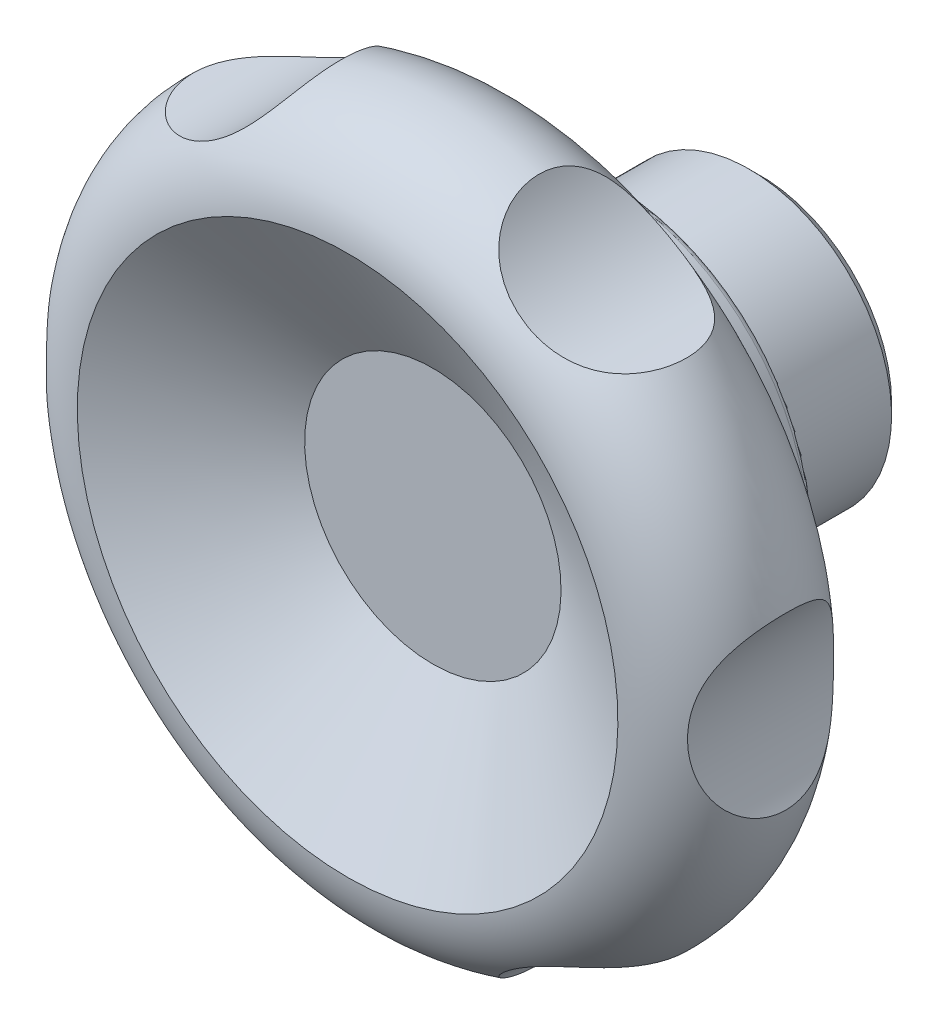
ISO-10303-21;
HEADER;
FILE_DESCRIPTION(('STEP AP214'),'2;1');
FILE_NAME('part.step','',(''),(''),'','','');
FILE_SCHEMA(('AUTOMOTIVE_DESIGN { 1 0 10303 214 1 1 1 1 }'));
ENDSEC;
DATA;
#1=APPLICATION_CONTEXT('core data for automotive mechanical design processes');
#2=APPLICATION_PROTOCOL_DEFINITION('international standard','automotive_design',2000,#1);
#3=PRODUCT_CONTEXT('',#1,'mechanical');
#4=PRODUCT('Part','Part','',(#3));
#5=PRODUCT_RELATED_PRODUCT_CATEGORY('part','',(#4));
#6=PRODUCT_DEFINITION_FORMATION('','',#4);
#7=PRODUCT_DEFINITION_CONTEXT('part definition',#1,'design');
#8=PRODUCT_DEFINITION('design','',#6,#7);
#9=PRODUCT_DEFINITION_SHAPE('','',#8);
#10=(LENGTH_UNIT() NAMED_UNIT(*) SI_UNIT(.MILLI.,.METRE.));
#11=(NAMED_UNIT(*) PLANE_ANGLE_UNIT() SI_UNIT($,.RADIAN.));
#12=(NAMED_UNIT(*) SI_UNIT($,.STERADIAN.) SOLID_ANGLE_UNIT());
#13=UNCERTAINTY_MEASURE_WITH_UNIT(LENGTH_MEASURE(1.E-05),#10,'distance_accuracy_value','');
#14=(GEOMETRIC_REPRESENTATION_CONTEXT(3) GLOBAL_UNCERTAINTY_ASSIGNED_CONTEXT((#13)) GLOBAL_UNIT_ASSIGNED_CONTEXT((#10,
#11,#12)) REPRESENTATION_CONTEXT('',''));
#15=CARTESIAN_POINT('',(0.,0.,0.));
#16=DIRECTION('',(0.,0.,1.));
#17=DIRECTION('',(1.,0.,0.));
#18=AXIS2_PLACEMENT_3D('',#15,#16,#17);
#19=CARTESIAN_POINT('',(0.,0.,22.5));
#20=DIRECTION('',(0.,0.,-1.));
#21=DIRECTION('',(0.499999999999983,0.866025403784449,0.));
#22=AXIS2_PLACEMENT_3D('',#19,#20,#21);
#23=TOROIDAL_SURFACE('',#22,18.5,6.5);
#24=CARTESIAN_POINT('',(-15.0760133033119,-18.1399713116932,18.4536650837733));
#25=CARTESIAN_POINT('',(-15.1888808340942,-18.1225924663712,18.5275569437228));
#26=CARTESIAN_POINT('',(-15.2993214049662,-18.1073907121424,18.6056769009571));
#27=CARTESIAN_POINT('',(-15.5142528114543,-18.080947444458,18.7703173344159));
#28=CARTESIAN_POINT('',(-15.6187440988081,-18.0697056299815,18.8568371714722));
#29=CARTESIAN_POINT('',(-15.8208518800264,-18.0506922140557,19.0381764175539));
#30=CARTESIAN_POINT('',(-15.918459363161,-18.0429250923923,19.1330063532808));
#31=CARTESIAN_POINT('',(-16.1056079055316,-18.0303413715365,19.3304242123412));
#32=CARTESIAN_POINT('',(-16.1951525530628,-18.0255234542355,19.4330086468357));
#33=CARTESIAN_POINT('',(-16.3654923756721,-18.0182420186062,19.6456113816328));
#34=CARTESIAN_POINT('',(-16.4462702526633,-18.0157830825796,19.7556437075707));
#35=CARTESIAN_POINT('',(-16.5981052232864,-18.0126375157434,19.9822530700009));
#36=CARTESIAN_POINT('',(-16.6691620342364,-18.0119509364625,20.0988302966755));
#37=CARTESIAN_POINT('',(-16.8009136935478,-18.0117714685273,20.3376902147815));
#38=CARTESIAN_POINT('',(-16.8616092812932,-18.0122784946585,20.4599724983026));
#39=CARTESIAN_POINT('',(-16.9721483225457,-18.0139553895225,20.7093408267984));
#40=CARTESIAN_POINT('',(-17.0219919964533,-18.0151252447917,20.8364267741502));
#41=CARTESIAN_POINT('',(-17.1091989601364,-18.017633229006,21.0907657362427));
#42=CARTESIAN_POINT('',(-17.1468771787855,-18.0189656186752,21.2179109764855));
#43=CARTESIAN_POINT('',(-17.2114168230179,-18.0214852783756,21.4749683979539));
#44=CARTESIAN_POINT('',(-17.2382743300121,-18.0226724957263,21.6048815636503));
#45=CARTESIAN_POINT('',(-17.2809883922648,-18.0246535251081,21.8664635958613));
#46=CARTESIAN_POINT('',(-17.2968484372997,-18.0254474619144,21.9981318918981));
#47=CARTESIAN_POINT('',(-17.3174981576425,-18.0264947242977,22.2623848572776));
#48=CARTESIAN_POINT('',(-17.3222837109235,-18.0267478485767,22.3949698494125));
#49=CARTESIAN_POINT('',(-17.3207445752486,-18.0266677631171,22.6604534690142));
#50=CARTESIAN_POINT('',(-17.3143881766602,-18.0263328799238,22.7933519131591));
#51=CARTESIAN_POINT('',(-17.2905336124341,-18.0251333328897,23.058192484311));
#52=CARTESIAN_POINT('',(-17.2730313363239,-18.0242684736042,23.1901342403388));
#53=CARTESIAN_POINT('',(-17.2269887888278,-18.022173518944,23.4520166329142));
#54=CARTESIAN_POINT('',(-17.1984532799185,-18.0209435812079,23.5819581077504));
#55=CARTESIAN_POINT('',(-17.1305013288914,-18.018381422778,23.8390148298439));
#56=CARTESIAN_POINT('',(-17.0910809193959,-18.017049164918,23.9661290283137));
#57=CARTESIAN_POINT('',(-17.0016279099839,-18.0146385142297,24.216543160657));
#58=CARTESIAN_POINT('',(-16.9515973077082,-18.0135600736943,24.3398438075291));
#59=CARTESIAN_POINT('',(-16.8412563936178,-18.0120912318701,24.5818153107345));
#60=CARTESIAN_POINT('',(-16.7809423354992,-18.0117010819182,24.7004844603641));
#61=CARTESIAN_POINT('',(-16.6505583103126,-18.012107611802,24.9322415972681));
#62=CARTESIAN_POINT('',(-16.5804941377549,-18.0129035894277,25.0453328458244));
#63=CARTESIAN_POINT('',(-16.4311554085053,-18.0162192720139,25.2652904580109));
#64=CARTESIAN_POINT('',(-16.3518775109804,-18.0187396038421,25.3721545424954));
#65=CARTESIAN_POINT('',(-16.1852387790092,-18.0260440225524,25.5784772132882));
#66=CARTESIAN_POINT('',(-16.0979175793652,-18.0308174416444,25.6779681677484));
#67=CARTESIAN_POINT('',(-15.9157095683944,-18.0431535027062,25.8695973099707));
#68=CARTESIAN_POINT('',(-15.8208200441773,-18.0507171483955,25.9617328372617));
#69=CARTESIAN_POINT('',(-15.5262039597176,-18.0783686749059,26.2264263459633));
#70=CARTESIAN_POINT('',(-15.3163791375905,-18.1034217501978,26.3874556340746));
#71=CARTESIAN_POINT('',(-14.8686967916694,-18.1714556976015,26.6835022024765));
#72=CARTESIAN_POINT('',(-14.6300183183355,-18.215166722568,26.8170890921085));
#73=CARTESIAN_POINT('',(-14.1410226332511,-18.3227971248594,27.0507463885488));
#74=CARTESIAN_POINT('',(-13.8906995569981,-18.3867267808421,27.1507996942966));
#75=CARTESIAN_POINT('',(-13.4947769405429,-18.5034672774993,27.2837112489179));
#76=CARTESIAN_POINT('',(-13.3504304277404,-18.549238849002,27.3269636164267));
#77=CARTESIAN_POINT('',(-13.0615145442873,-18.6475701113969,27.4041151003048));
#78=CARTESIAN_POINT('',(-12.9169451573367,-18.7001303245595,27.4380134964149));
#79=CARTESIAN_POINT('',(-12.6285331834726,-18.8119753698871,27.4969985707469));
#80=CARTESIAN_POINT('',(-12.4846910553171,-18.8712639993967,27.5220802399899));
#81=CARTESIAN_POINT('',(-12.1986412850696,-18.996387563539,27.5638637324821));
#82=CARTESIAN_POINT('',(-12.0564337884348,-19.0622230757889,27.5805648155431));
#83=CARTESIAN_POINT('',(-11.7484278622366,-19.2129316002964,27.6082460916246));
#84=CARTESIAN_POINT('',(-11.5831042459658,-19.2990784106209,27.6176078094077));
#85=CARTESIAN_POINT('',(-11.2568496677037,-19.479795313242,27.6253113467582));
#86=CARTESIAN_POINT('',(-11.0959191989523,-19.5743663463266,27.6236519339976));
#87=CARTESIAN_POINT('',(-10.7792459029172,-19.7714553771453,27.6092533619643));
#88=CARTESIAN_POINT('',(-10.6235092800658,-19.8739824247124,27.5965014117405));
#89=CARTESIAN_POINT('',(-10.318349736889,-20.0861348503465,27.5595371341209));
#90=CARTESIAN_POINT('',(-10.1689268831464,-20.19576030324,27.5353246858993));
#91=CARTESIAN_POINT('',(-9.86672279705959,-20.4293370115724,27.472594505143));
#92=CARTESIAN_POINT('',(-9.71448491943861,-20.5537505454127,27.4331660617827));
#93=CARTESIAN_POINT('',(-9.41947613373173,-20.80811112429,27.3392996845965));
#94=CARTESIAN_POINT('',(-9.27670658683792,-20.9380589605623,27.2848595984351));
#95=CARTESIAN_POINT('',(-9.00215784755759,-21.20115278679,27.1599030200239));
#96=CARTESIAN_POINT('',(-8.87035466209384,-21.3342909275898,27.0894229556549));
#97=CARTESIAN_POINT('',(-8.61858815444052,-21.6014673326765,26.9312007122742));
#98=CARTESIAN_POINT('',(-8.49861896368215,-21.7355051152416,26.8434671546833));
#99=CARTESIAN_POINT('',(-8.30514542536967,-21.9620546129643,26.678616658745));
#100=CARTESIAN_POINT('',(-8.22839449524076,-22.0551206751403,26.6060369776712));
#101=CARTESIAN_POINT('',(-8.08155049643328,-22.2389780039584,26.4518426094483));
#102=CARTESIAN_POINT('',(-8.01145587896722,-22.329769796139,26.3702300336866));
#103=CARTESIAN_POINT('',(-7.87814202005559,-22.5078131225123,26.1980471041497));
#104=CARTESIAN_POINT('',(-7.81492166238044,-22.5950652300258,26.1074782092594));
#105=CARTESIAN_POINT('',(-7.69548617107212,-22.7647285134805,25.917683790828));
#106=CARTESIAN_POINT('',(-7.63926796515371,-22.8471418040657,25.8184620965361));
#107=CARTESIAN_POINT('',(-7.53363447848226,-23.0062071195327,25.611433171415));
#108=CARTESIAN_POINT('',(-7.48424408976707,-23.0828376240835,25.5035966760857));
#109=CARTESIAN_POINT('',(-7.3924223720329,-23.2288429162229,25.2803114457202));
#110=CARTESIAN_POINT('',(-7.34999109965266,-23.2982176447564,25.1648626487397));
#111=CARTESIAN_POINT('',(-7.27191941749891,-23.4286823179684,24.9271540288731));
#112=CARTESIAN_POINT('',(-7.23628032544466,-23.4897706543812,24.8048928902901));
#113=CARTESIAN_POINT('',(-7.17158876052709,-23.6027586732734,24.5545250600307));
#114=CARTESIAN_POINT('',(-7.14253603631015,-23.6546587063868,24.426418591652));
#115=CARTESIAN_POINT('',(-7.09227197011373,-23.7458429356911,24.1729195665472));
#116=CARTESIAN_POINT('',(-7.0707050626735,-23.7856820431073,24.0477964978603));
#117=CARTESIAN_POINT('',(-7.03300789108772,-23.8561103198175,23.7941235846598));
#118=CARTESIAN_POINT('',(-7.01687954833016,-23.8866962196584,23.6655725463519));
#119=CARTESIAN_POINT('',(-6.98991078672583,-23.9382423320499,23.4060687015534));
#120=CARTESIAN_POINT('',(-6.97906811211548,-23.9592066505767,23.2751169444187));
#121=CARTESIAN_POINT('',(-6.96253496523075,-23.9913077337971,23.0116430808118));
#122=CARTESIAN_POINT('',(-6.956846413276,-24.0024408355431,22.8791204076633));
#123=CARTESIAN_POINT('',(-6.95056630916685,-24.0147371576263,22.6137310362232));
#124=CARTESIAN_POINT('',(-6.94996566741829,-24.0159181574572,22.480865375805));
#125=CARTESIAN_POINT('',(-6.95383100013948,-24.0083431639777,22.2154423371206));
#126=CARTESIAN_POINT('',(-6.95829883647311,-23.9995835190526,22.0828850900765));
#127=CARTESIAN_POINT('',(-6.972354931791,-23.9722188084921,21.8191164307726));
#128=CARTESIAN_POINT('',(-6.98194119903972,-23.9536175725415,21.6879045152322));
#129=CARTESIAN_POINT('',(-7.00634688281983,-23.9067632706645,21.4276587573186));
#130=CARTESIAN_POINT('',(-7.02116821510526,-23.8785066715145,21.298625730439));
#131=CARTESIAN_POINT('',(-7.05624050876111,-23.8125796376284,21.0434103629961));
#132=CARTESIAN_POINT('',(-7.07650418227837,-23.7748871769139,20.917235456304));
#133=CARTESIAN_POINT('',(-7.12263379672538,-23.6905609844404,20.6689614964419));
#134=CARTESIAN_POINT('',(-7.14849978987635,-23.6439271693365,20.5468624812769));
#135=CARTESIAN_POINT('',(-7.20602745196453,-23.5422994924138,20.3076441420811));
#136=CARTESIAN_POINT('',(-7.23768777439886,-23.4873075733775,20.1905236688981));
#137=CARTESIAN_POINT('',(-7.306997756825,-23.3696557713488,19.9620468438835));
#138=CARTESIAN_POINT('',(-7.34464749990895,-23.3069957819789,19.8506905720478));
#139=CARTESIAN_POINT('',(-7.42583551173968,-23.175250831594,19.6351538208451));
#140=CARTESIAN_POINT('',(-7.46933537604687,-23.1062086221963,19.5309327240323));
#141=CARTESIAN_POINT('',(-7.56251356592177,-22.9622687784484,19.3294799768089));
#142=CARTESIAN_POINT('',(-7.61219397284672,-22.887369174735,19.2322506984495));
#143=CARTESIAN_POINT('',(-7.71773569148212,-22.7327630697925,19.045323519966));
#144=CARTESIAN_POINT('',(-7.77359477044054,-22.6530583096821,18.955622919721));
#145=CARTESIAN_POINT('',(-7.89145270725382,-22.4898647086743,18.7840126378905));
#146=CARTESIAN_POINT('',(-7.95345378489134,-22.4063745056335,18.7021057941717));
#147=CARTESIAN_POINT('',(-8.15239279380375,-22.1467668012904,18.46373728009));
#148=CARTESIAN_POINT('',(-8.29917792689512,-21.9661566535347,18.3201402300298));
#149=CARTESIAN_POINT('',(-8.61631499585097,-21.6022998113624,18.0664151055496));
#150=CARTESIAN_POINT('',(-8.78667812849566,-21.4190519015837,17.9563030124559));
#151=CARTESIAN_POINT('',(-9.06873701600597,-21.1366407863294,17.8085966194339));
#152=CARTESIAN_POINT('',(-9.17341815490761,-21.0358269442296,17.7603712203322));
#153=CARTESIAN_POINT('',(-9.38879840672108,-20.8366328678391,17.6731267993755));
#154=CARTESIAN_POINT('',(-9.49949793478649,-20.7382528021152,17.634108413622));
#155=CARTESIAN_POINT('',(-9.72641046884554,-20.5447709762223,17.5647489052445));
#156=CARTESIAN_POINT('',(-9.84262581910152,-20.4496706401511,17.5344115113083));
#157=CARTESIAN_POINT('',(-10.0800179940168,-20.2634739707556,17.4819508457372));
#158=CARTESIAN_POINT('',(-10.2011953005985,-20.172378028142,17.4598283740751));
#159=CARTESIAN_POINT('',(-10.4709100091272,-19.9782741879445,17.4200310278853));
#160=CARTESIAN_POINT('',(-10.6203514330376,-19.8761931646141,17.403943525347));
#161=CARTESIAN_POINT('',(-10.924644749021,-19.6792148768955,17.3823443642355));
#162=CARTESIAN_POINT('',(-11.0794972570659,-19.5843184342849,17.3768339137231));
#163=CARTESIAN_POINT('',(-11.3939820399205,-19.4021610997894,17.3762401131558));
#164=CARTESIAN_POINT('',(-11.5536215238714,-19.3149125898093,17.3811733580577));
#165=CARTESIAN_POINT('',(-11.8764907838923,-19.1486933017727,17.4016368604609));
#166=CARTESIAN_POINT('',(-12.0397205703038,-19.0697225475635,17.4171671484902));
#167=CARTESIAN_POINT('',(-12.3858816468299,-18.9126308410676,17.4614331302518));
#168=CARTESIAN_POINT('',(-12.5690919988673,-18.8354577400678,17.4913772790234));
#169=CARTESIAN_POINT('',(-12.9369467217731,-18.6919865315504,17.5655990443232));
#170=CARTESIAN_POINT('',(-13.121591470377,-18.6256913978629,17.6098805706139));
#171=CARTESIAN_POINT('',(-13.4895192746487,-18.5043942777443,17.7137305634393));
#172=CARTESIAN_POINT('',(-13.6728048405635,-18.4493519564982,17.7732426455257));
#173=CARTESIAN_POINT('',(-14.0360813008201,-18.3502364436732,17.9088053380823));
#174=CARTESIAN_POINT('',(-14.2160750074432,-18.3061534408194,17.9848410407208));
#175=CARTESIAN_POINT('',(-14.5101091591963,-18.2416462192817,18.1258063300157));
#176=CARTESIAN_POINT('',(-14.6258857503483,-18.2182607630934,18.1858083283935));
#177=CARTESIAN_POINT('',(-14.8538808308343,-18.175884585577,18.3137565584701));
#178=CARTESIAN_POINT('',(-14.9660978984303,-18.1568956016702,18.381705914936));
#179=CARTESIAN_POINT('',(-15.0760133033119,-18.1399713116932,18.4536650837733));
#180=B_SPLINE_CURVE_WITH_KNOTS('',3,(#24,#25,#26,#27,#28,#29,#30,#31,#32,#33,#34,#35,#36,#37,
#38,#39,#40,#41,#42,#43,#44,#45,#46,#47,#48,#49,#50,#51,#52,#53,#54,#55,#56,#57,#58,#59,#60,#61,
#62,#63,#64,#65,#66,#67,#68,#69,#70,#71,#72,#73,#74,#75,#76,#77,#78,#79,#80,#81,#82,#83,#84,#85,
#86,#87,#88,#89,#90,#91,#92,#93,#94,#95,#96,#97,#98,#99,#100,#101,#102,#103,#104,#105,#106,#107,
#108,#109,#110,#111,#112,#113,#114,#115,#116,#117,#118,#119,#120,#121,#122,#123,#124,#125,#126,
#127,#128,#129,#130,#131,#132,#133,#134,#135,#136,#137,#138,#139,#140,#141,#142,#143,#144,#145,
#146,#147,#148,#149,#150,#151,#152,#153,#154,#155,#156,#157,#158,#159,#160,#161,#162,#163,#164,
#165,#166,#167,#168,#169,#170,#171,#172,#173,#174,#175,#176,#177,#178,#179),.UNSPECIFIED.,.T.,
.F.,(4,2,2,2,2,2,2,2,2,2,2,2,2,2,2,2,2,2,2,2,2,2,2,2,2,2,2,2,2,2,2,2,2,2,2,2,2,2,2,2,2,2,2,2,2,
2,2,2,2,2,2,2,2,2,2,2,2,2,2,2,2,2,2,2,2,2,2,2,2,2,2,2,2,2,2,2,2,4),(0.,0.407952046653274,
0.815873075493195,1.22431851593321,1.63258127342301,2.04163548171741,2.45070158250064,
2.85973847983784,3.26876706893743,3.66615007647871,4.06367686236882,4.46107744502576,
4.8586259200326,5.25730764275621,5.65613647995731,6.05479335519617,6.45359572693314,
6.85232308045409,7.25119600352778,7.6498328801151,8.048614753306,8.44552715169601,
8.84258246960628,9.63598703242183,10.4637888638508,11.2920122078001,11.764103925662,
12.236231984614,12.7086278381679,13.1810654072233,13.7404473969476,14.2998919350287,
14.8599824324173,15.4200788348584,16.0208260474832,16.6216594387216,17.2211416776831,
17.8203251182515,18.2422530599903,18.6640825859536,19.0858435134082,19.5074187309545,
19.9304924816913,20.353569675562,20.7767288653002,21.1998719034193,21.598614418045,
21.9974976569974,22.396210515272,22.7950718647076,23.19322049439,23.5915154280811,
23.9896554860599,24.3879413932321,24.7871658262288,25.1863939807,25.5855294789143,
25.984670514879,26.3813087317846,26.7780808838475,27.1747101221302,27.5714832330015,
28.3882834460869,29.2054728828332,29.6644828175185,30.1235244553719,30.5827629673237,
31.0420461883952,31.5865664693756,32.1311489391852,32.6765973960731,33.222047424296,
33.8243921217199,34.4269012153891,35.0272112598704,35.6269819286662,36.0241070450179,
36.4213888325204),.UNSPECIFIED.);
#181=CARTESIAN_POINT('',(-15.0760133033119,-18.1399713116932,18.4536650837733));
#182=VERTEX_POINT('',#181);
#183=EDGE_CURVE('E265',#182,#182,#180,.T.);
#184=ORIENTED_EDGE('',*,*,#183,.T.);
#185=EDGE_LOOP('',(#184));
#186=FACE_BOUND('',#185,.T.);
#187=CARTESIAN_POINT('',(12.4988425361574,-18.8665240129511,17.4816343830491));
#188=CARTESIAN_POINT('',(12.3198589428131,-18.9415238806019,17.4517283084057));
#189=CARTESIAN_POINT('',(12.1418857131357,-19.0216788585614,17.4284470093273));
#190=CARTESIAN_POINT('',(11.7894290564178,-19.1919181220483,17.3944385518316));
#191=CARTESIAN_POINT('',(11.6149478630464,-19.2820085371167,17.3837191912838));
#192=CARTESIAN_POINT('',(11.2702763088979,-19.471858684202,17.3745006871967));
#193=CARTESIAN_POINT('',(11.1001011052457,-19.5716478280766,17.3760399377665));
#194=CARTESIAN_POINT('',(10.7657925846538,-19.7799474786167,17.3914796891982));
#195=CARTESIAN_POINT('',(10.6016582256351,-19.8884564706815,17.4053780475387));
#196=CARTESIAN_POINT('',(10.2800730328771,-20.1136115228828,17.4460257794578));
#197=CARTESIAN_POINT('',(10.1226404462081,-20.2302777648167,17.4728080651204));
#198=CARTESIAN_POINT('',(9.81598314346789,-20.4703451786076,17.5400370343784));
#199=CARTESIAN_POINT('',(9.66675940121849,-20.5937471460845,17.5804853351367));
#200=CARTESIAN_POINT('',(9.37801145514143,-20.8454334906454,17.6759817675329));
#201=CARTESIAN_POINT('',(9.23846483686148,-20.9737054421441,17.7309946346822));
#202=CARTESIAN_POINT('',(8.96984946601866,-21.233412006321,17.8568151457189));
#203=CARTESIAN_POINT('',(8.84077664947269,-21.3648453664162,17.9276166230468));
#204=CARTESIAN_POINT('',(8.62629581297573,-21.5940827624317,18.0654295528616));
#205=CARTESIAN_POINT('',(8.53826556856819,-21.6917376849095,18.1286327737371));
#206=CARTESIAN_POINT('',(8.36889602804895,-21.8862828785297,18.2645986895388));
#207=CARTESIAN_POINT('',(8.28755845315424,-21.9831729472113,18.337363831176));
#208=CARTESIAN_POINT('',(8.13199067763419,-22.1748088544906,18.4925722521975));
#209=CARTESIAN_POINT('',(8.05775755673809,-22.2695555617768,18.5750115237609));
#210=CARTESIAN_POINT('',(7.91665353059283,-22.4555099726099,18.7495208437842));
#211=CARTESIAN_POINT('',(7.84977920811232,-22.5467193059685,18.8415863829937));
#212=CARTESIAN_POINT('',(7.72318717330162,-22.7246705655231,19.0356132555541));
#213=CARTESIAN_POINT('',(7.66350752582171,-22.8113874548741,19.1376224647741));
#214=CARTESIAN_POINT('',(7.55173807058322,-22.9784371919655,19.3506418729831));
#215=CARTESIAN_POINT('',(7.49964835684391,-23.0587699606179,19.4616521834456));
#216=CARTESIAN_POINT('',(7.40297727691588,-23.2117339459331,19.6919583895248));
#217=CARTESIAN_POINT('',(7.35839649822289,-23.2843645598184,19.8112549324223));
#218=CARTESIAN_POINT('',(7.27657519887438,-23.4207374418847,20.0572138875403));
#219=CARTESIAN_POINT('',(7.23933420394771,-23.4844802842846,20.1838758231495));
#220=CARTESIAN_POINT('',(7.17475477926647,-23.5971912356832,20.4327107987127));
#221=CARTESIAN_POINT('',(7.14685046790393,-23.6469471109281,20.5543815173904));
#222=CARTESIAN_POINT('',(7.0967938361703,-23.737546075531,20.8021970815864));
#223=CARTESIAN_POINT('',(7.07464352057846,-23.778386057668,20.9283434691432));
#224=CARTESIAN_POINT('',(7.03591819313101,-23.850621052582,21.1840820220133));
#225=CARTESIAN_POINT('',(7.0193406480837,-23.8820203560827,21.3136725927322));
#226=CARTESIAN_POINT('',(6.99156908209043,-23.9350485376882,21.5754552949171));
#227=CARTESIAN_POINT('',(6.98037707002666,-23.9566737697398,21.7076483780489));
#228=CARTESIAN_POINT('',(6.96337291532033,-23.9896732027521,21.9718343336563));
#229=CARTESIAN_POINT('',(6.95749042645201,-24.001181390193,22.1038059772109));
#230=CARTESIAN_POINT('',(6.95077863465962,-24.0143200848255,22.3684164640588));
#231=CARTESIAN_POINT('',(6.9499511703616,-24.0159469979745,22.5010555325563));
#232=CARTESIAN_POINT('',(6.95334375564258,-24.0092976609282,22.7659716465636));
#233=CARTESIAN_POINT('',(6.95756194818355,-24.0010250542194,22.8982488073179));
#234=CARTESIAN_POINT('',(6.97109557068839,-23.9746645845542,23.1616082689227));
#235=CARTESIAN_POINT('',(6.98041287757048,-23.9565731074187,23.2926901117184));
#236=CARTESIAN_POINT('',(7.0043119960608,-23.9106513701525,23.5533309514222));
#237=CARTESIAN_POINT('',(7.01891984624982,-23.8827729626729,23.6828790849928));
#238=CARTESIAN_POINT('',(7.05355410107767,-23.8175947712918,23.9388955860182));
#239=CARTESIAN_POINT('',(7.07358250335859,-23.7802915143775,24.0653627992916));
#240=CARTESIAN_POINT('',(7.11923132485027,-23.696725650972,24.3141861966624));
#241=CARTESIAN_POINT('',(7.14484870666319,-23.6504679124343,24.4365445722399));
#242=CARTESIAN_POINT('',(7.20189096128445,-23.5495278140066,24.6763860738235));
#243=CARTESIAN_POINT('',(7.23331792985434,-23.494842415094,24.7938674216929));
#244=CARTESIAN_POINT('',(7.30194623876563,-23.3781289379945,25.0223468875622));
#245=CARTESIAN_POINT('',(7.33910875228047,-23.3161508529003,25.1333821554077));
#246=CARTESIAN_POINT('',(7.41950053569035,-23.1853867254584,25.3490814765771));
#247=CARTESIAN_POINT('',(7.46273199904,-23.116598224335,25.4537432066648));
#248=CARTESIAN_POINT('',(7.6016836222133,-22.9014221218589,25.7570792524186));
#249=CARTESIAN_POINT('',(7.70673834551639,-22.7460873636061,25.9453671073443));
#250=CARTESIAN_POINT('',(7.943160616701,-22.4178363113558,26.2928505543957));
#251=CARTESIAN_POINT('',(8.07488323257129,-22.2447002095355,26.4515912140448));
#252=CARTESIAN_POINT('',(8.36243783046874,-21.8914179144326,26.7361307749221));
#253=CARTESIAN_POINT('',(8.51827932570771,-21.7112689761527,26.8619166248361));
#254=CARTESIAN_POINT('',(8.77614077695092,-21.4332133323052,27.0321886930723));
#255=CARTESIAN_POINT('',(8.87068897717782,-21.3349013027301,27.0877386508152));
#256=CARTESIAN_POINT('',(9.06583968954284,-21.139576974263,27.1898381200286));
#257=CARTESIAN_POINT('',(9.1664425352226,-21.042564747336,27.236387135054));
#258=CARTESIAN_POINT('',(9.3732504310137,-20.8507556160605,27.3209483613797));
#259=CARTESIAN_POINT('',(9.47945770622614,-20.7559596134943,27.3589571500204));
#260=CARTESIAN_POINT('',(9.69697925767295,-20.5693730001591,27.4268993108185));
#261=CARTESIAN_POINT('',(9.80829407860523,-20.4775827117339,27.4568318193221));
#262=CARTESIAN_POINT('',(10.0559753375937,-20.2814871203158,27.5137405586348));
#263=CARTESIAN_POINT('',(10.193251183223,-20.1778939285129,27.5392210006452));
#264=CARTESIAN_POINT('',(10.4735152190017,-19.9766135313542,27.5801174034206));
#265=CARTESIAN_POINT('',(10.6165039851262,-19.8789269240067,27.5955323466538));
#266=CARTESIAN_POINT('',(10.907611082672,-19.6900147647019,27.6166803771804));
#267=CARTESIAN_POINT('',(11.0557350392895,-19.5987966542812,27.6224024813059));
#268=CARTESIAN_POINT('',(11.356191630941,-19.4234678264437,27.6242743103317));
#269=CARTESIAN_POINT('',(11.5085244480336,-19.3393574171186,27.6204236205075));
#270=CARTESIAN_POINT('',(11.8384688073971,-19.1672480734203,27.601820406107));
#271=CARTESIAN_POINT('',(12.0165982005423,-19.0803930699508,27.5855974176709));
#272=CARTESIAN_POINT('',(12.3759233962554,-18.9169803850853,27.5400242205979));
#273=CARTESIAN_POINT('',(12.5571197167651,-18.8404244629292,27.5106717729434));
#274=CARTESIAN_POINT('',(12.9207082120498,-18.6980449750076,27.4380163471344));
#275=CARTESIAN_POINT('',(13.1030988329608,-18.6322095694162,27.3947289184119));
#276=CARTESIAN_POINT('',(13.4672518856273,-18.5113593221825,27.2930986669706));
#277=CARTESIAN_POINT('',(13.649014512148,-18.4563407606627,27.2347610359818));
#278=CARTESIAN_POINT('',(13.9666691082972,-18.3688525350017,27.1176619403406));
#279=CARTESIAN_POINT('',(14.1031996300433,-18.3341311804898,27.0622939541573));
#280=CARTESIAN_POINT('',(14.3732651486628,-18.2707918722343,26.9416608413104));
#281=CARTESIAN_POINT('',(14.5068007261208,-18.242172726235,26.876397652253));
#282=CARTESIAN_POINT('',(14.7694366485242,-18.1907945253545,26.7356575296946));
#283=CARTESIAN_POINT('',(14.8985400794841,-18.1680313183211,26.660187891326));
#284=CARTESIAN_POINT('',(15.1509604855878,-18.1279452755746,26.498811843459));
#285=CARTESIAN_POINT('',(15.2742773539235,-18.1106225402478,26.4129052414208));
#286=CARTESIAN_POINT('',(15.514390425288,-18.0807942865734,26.2301213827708));
#287=CARTESIAN_POINT('',(15.6311401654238,-18.0683201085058,26.1331778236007));
#288=CARTESIAN_POINT('',(15.8557673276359,-18.0476787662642,25.9290914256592));
#289=CARTESIAN_POINT('',(15.9636454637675,-18.0395112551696,25.8219494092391));
#290=CARTESIAN_POINT('',(16.1691608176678,-18.0267141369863,25.5980536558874));
#291=CARTESIAN_POINT('',(16.2667979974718,-18.0220845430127,25.4812998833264));
#292=CARTESIAN_POINT('',(16.4506160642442,-18.0155410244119,25.2390317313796));
#293=CARTESIAN_POINT('',(16.5367980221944,-18.0136268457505,25.1135181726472));
#294=CARTESIAN_POINT('',(16.6882892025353,-18.0117913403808,24.8684140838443));
#295=CARTESIAN_POINT('',(16.7548405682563,-18.0116814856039,24.7495903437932));
#296=CARTESIAN_POINT('',(16.877410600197,-18.01241807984,24.5066350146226));
#297=CARTESIAN_POINT('',(16.933429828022,-18.0132644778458,24.3825037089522));
#298=CARTESIAN_POINT('',(17.034494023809,-18.0154143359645,24.1298714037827));
#299=CARTESIAN_POINT('',(17.0795400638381,-18.016717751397,24.0013708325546));
#300=CARTESIAN_POINT('',(17.1583477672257,-18.0193622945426,23.7409540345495));
#301=CARTESIAN_POINT('',(17.1921093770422,-18.0207034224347,23.6090377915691));
#302=CARTESIAN_POINT('',(17.2473698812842,-18.0230673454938,23.3463975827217));
#303=CARTESIAN_POINT('',(17.2691764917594,-18.0240977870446,23.215738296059));
#304=CARTESIAN_POINT('',(17.3017857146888,-18.025687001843,22.9530055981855));
#305=CARTESIAN_POINT('',(17.3125846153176,-18.0262456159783,22.820931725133));
#306=CARTESIAN_POINT('',(17.3231049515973,-18.0267894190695,22.5563914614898));
#307=CARTESIAN_POINT('',(17.3228304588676,-18.0267748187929,22.42392523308));
#308=CARTESIAN_POINT('',(17.3112135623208,-18.0261752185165,22.1594310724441));
#309=CARTESIAN_POINT('',(17.2998670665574,-18.0255900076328,22.0274033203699));
#310=CARTESIAN_POINT('',(17.2660625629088,-18.0239500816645,21.763994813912));
#311=CARTESIAN_POINT('',(17.2435399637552,-18.0228926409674,21.6326223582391));
#312=CARTESIAN_POINT('',(17.1874716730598,-18.0205178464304,21.3722020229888));
#313=CARTESIAN_POINT('',(17.1539219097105,-18.0192003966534,21.2431550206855));
#314=CARTESIAN_POINT('',(17.0760282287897,-18.016614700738,20.9884265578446));
#315=CARTESIAN_POINT('',(17.0316894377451,-18.0153464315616,20.862743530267));
#316=CARTESIAN_POINT('',(16.932492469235,-18.0132530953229,20.6155420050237));
#317=CARTESIAN_POINT('',(16.8776304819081,-18.01242818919,20.4940250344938));
#318=CARTESIAN_POINT('',(16.7581000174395,-18.0116925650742,20.2566531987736));
#319=CARTESIAN_POINT('',(16.6934805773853,-18.0117774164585,20.1407736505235));
#320=CARTESIAN_POINT('',(16.5547405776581,-18.0133654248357,19.9148027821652));
#321=CARTESIAN_POINT('',(16.4806165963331,-18.0148690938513,19.8047135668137));
#322=CARTESIAN_POINT('',(16.3235855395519,-18.0198387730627,19.5911459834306));
#323=CARTESIAN_POINT('',(16.2406840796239,-18.0233035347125,19.4876634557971));
#324=CARTESIAN_POINT('',(16.0668000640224,-18.0327426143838,19.2877899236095));
#325=CARTESIAN_POINT('',(15.9758145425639,-18.0387178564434,19.1914015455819));
#326=CARTESIAN_POINT('',(15.7862179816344,-18.0537400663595,19.00577964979));
#327=CARTESIAN_POINT('',(15.6875735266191,-18.0628011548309,18.9165813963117));
#328=CARTESIAN_POINT('',(15.4839950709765,-18.0844659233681,18.7461223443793));
#329=CARTESIAN_POINT('',(15.3790588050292,-18.0970708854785,18.6648644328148));
#330=CARTESIAN_POINT('',(15.056277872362,-18.1408698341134,18.4332465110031));
#331=CARTESIAN_POINT('',(14.8304006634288,-18.1780520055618,18.2949841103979));
#332=CARTESIAN_POINT('',(14.3479751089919,-18.2742824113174,18.0410774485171));
#333=CARTESIAN_POINT('',(14.0904026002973,-18.3347869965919,17.9279758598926));
#334=CARTESIAN_POINT('',(13.5692315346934,-18.4783015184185,17.7358029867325));
#335=CARTESIAN_POINT('',(13.3056383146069,-18.5612921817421,17.6567027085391));
#336=CARTESIAN_POINT('',(12.951747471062,-18.6879624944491,17.5707536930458));
#337=CARTESIAN_POINT('',(12.8609198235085,-18.7218299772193,17.550496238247));
#338=CARTESIAN_POINT('',(12.6795900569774,-18.7922032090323,17.513476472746));
#339=CARTESIAN_POINT('',(12.5890878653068,-18.8287083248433,17.4967133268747));
#340=CARTESIAN_POINT('',(12.4988425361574,-18.8665240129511,17.4816343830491));
#341=B_SPLINE_CURVE_WITH_KNOTS('',3,(#187,#188,#189,#190,#191,#192,#193,#194,#195,#196,#197,
#198,#199,#200,#201,#202,#203,#204,#205,#206,#207,#208,#209,#210,#211,#212,#213,#214,#215,#216,
#217,#218,#219,#220,#221,#222,#223,#224,#225,#226,#227,#228,#229,#230,#231,#232,#233,#234,#235,
#236,#237,#238,#239,#240,#241,#242,#243,#244,#245,#246,#247,#248,#249,#250,#251,#252,#253,#254,
#255,#256,#257,#258,#259,#260,#261,#262,#263,#264,#265,#266,#267,#268,#269,#270,#271,#272,#273,
#274,#275,#276,#277,#278,#279,#280,#281,#282,#283,#284,#285,#286,#287,#288,#289,#290,#291,#292,
#293,#294,#295,#296,#297,#298,#299,#300,#301,#302,#303,#304,#305,#306,#307,#308,#309,#310,#311,
#312,#313,#314,#315,#316,#317,#318,#319,#320,#321,#322,#323,#324,#325,#326,#327,#328,#329,#330,
#331,#332,#333,#334,#335,#336,#337,#338,#339,#340),.UNSPECIFIED.,.T.,.F.,(4,2,2,2,2,2,2,2,2,2,2,
2,2,2,2,2,2,2,2,2,2,2,2,2,2,2,2,2,2,2,2,2,2,2,2,2,2,2,2,2,2,2,2,2,2,2,2,2,2,2,2,2,2,2,2,2,2,2,2,
2,2,2,2,2,2,2,2,2,2,2,2,2,2,2,2,2,4),(0.,0.58895958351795,1.17828457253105,1.76945605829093,
2.36052508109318,2.95311207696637,3.54576922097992,4.13700431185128,4.72800888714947,
5.16521887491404,5.60254095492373,6.03968249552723,6.47662017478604,6.91577657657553,
7.35493841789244,7.79413460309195,8.23330239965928,8.63595757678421,9.0387528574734,
9.44136479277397,9.84412679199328,10.24147071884,10.6389591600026,11.0363013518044,
11.4337898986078,11.8332619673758,12.2328814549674,12.6322843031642,13.0318315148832,
13.428783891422,13.8258801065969,14.6191660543,15.4238054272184,16.2287629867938,
16.6702494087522,17.1117601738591,17.5534475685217,17.99518217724,18.5162308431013,
19.0373321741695,19.5590235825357,20.0807375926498,20.6765375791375,21.2724392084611,
21.8676781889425,22.4627121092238,22.9163787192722,23.3699566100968,23.8232119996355,
24.2764757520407,24.7326224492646,25.1887323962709,25.6448440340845,26.1009129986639,
26.5089850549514,26.9170353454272,27.3250457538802,27.7330580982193,28.1300058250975,
28.5270873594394,28.9240228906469,29.3211051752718,29.7205095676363,30.1200616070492,
30.5194241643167,30.9189315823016,31.3164942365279,31.7142004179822,32.1116536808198,
32.5092533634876,32.908697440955,33.3082862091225,34.1072146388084,34.9673201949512,
35.8266908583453,36.1237212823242,36.4206806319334),.UNSPECIFIED.);
#342=CARTESIAN_POINT('',(12.4988425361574,-18.8665240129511,17.4816343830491));
#343=VERTEX_POINT('',#342);
#344=EDGE_CURVE('E9',#343,#343,#341,.T.);
#345=ORIENTED_EDGE('',*,*,#344,.T.);
#346=EDGE_LOOP('',(#345));
#347=FACE_BOUND('',#346,.T.);
#348=CARTESIAN_POINT('',(22.9821144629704,3.22088246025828,18.0170518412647));
#349=CARTESIAN_POINT('',(22.9325272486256,3.05895013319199,17.9418961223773));
#350=CARTESIAN_POINT('',(22.8857015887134,2.89263061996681,17.8741717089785));
#351=CARTESIAN_POINT('',(22.7989541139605,2.55311061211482,17.7527600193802));
#352=CARTESIAN_POINT('',(22.7590387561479,2.37990386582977,17.6990858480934));
#353=CARTESIAN_POINT('',(22.6870120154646,2.02773416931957,17.6046937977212));
#354=CARTESIAN_POINT('',(22.6549289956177,1.84875288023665,17.5640228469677));
#355=CARTESIAN_POINT('',(22.5994594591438,1.48716955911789,17.495004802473));
#356=CARTESIAN_POINT('',(22.5760710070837,1.30456834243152,17.4666549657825));
#357=CARTESIAN_POINT('',(22.5385583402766,0.938321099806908,17.4216975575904));
#358=CARTESIAN_POINT('',(22.5243697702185,0.754691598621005,17.4050083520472));
#359=CARTESIAN_POINT('',(22.505237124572,0.386284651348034,17.3825922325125));
#360=CARTESIAN_POINT('',(22.500293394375,0.20150716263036,17.3768657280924));
#361=CARTESIAN_POINT('',(22.4997320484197,-0.168048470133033,17.3762130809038));
#362=CARTESIAN_POINT('',(22.5041127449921,-0.352826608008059,17.3812849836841));
#363=CARTESIAN_POINT('',(22.5221250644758,-0.721312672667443,17.402370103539));
#364=CARTESIAN_POINT('',(22.5357570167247,-0.905020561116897,17.4183837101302));
#365=CARTESIAN_POINT('',(22.5735961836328,-1.28583002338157,17.4636493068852));
#366=CARTESIAN_POINT('',(22.5986081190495,-1.4827333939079,17.4939163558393));
#367=CARTESIAN_POINT('',(22.6587186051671,-1.87228654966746,17.5687686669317));
#368=CARTESIAN_POINT('',(22.6938186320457,-2.06493570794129,17.6133560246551));
#369=CARTESIAN_POINT('',(22.7731451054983,-2.44376138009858,17.7179076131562));
#370=CARTESIAN_POINT('',(22.8173564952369,-2.62994798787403,17.7778465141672));
#371=CARTESIAN_POINT('',(22.9136224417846,-2.99399574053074,17.9143394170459));
#372=CARTESIAN_POINT('',(22.965673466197,-3.17186058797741,17.9908859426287));
#373=CARTESIAN_POINT('',(23.0603552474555,-3.46855137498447,18.1376779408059));
#374=CARTESIAN_POINT('',(23.1015385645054,-3.58995473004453,18.2036784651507));
#375=CARTESIAN_POINT('',(23.1861946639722,-3.82637894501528,18.3451002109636));
#376=CARTESIAN_POINT('',(23.2296680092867,-3.94139822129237,18.4205237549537));
#377=CARTESIAN_POINT('',(23.317897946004,-4.16402845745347,18.5808248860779));
#378=CARTESIAN_POINT('',(23.3626538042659,-4.2716435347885,18.6656971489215));
#379=CARTESIAN_POINT('',(23.4523797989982,-4.47862112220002,18.8447840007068));
#380=CARTESIAN_POINT('',(23.4973498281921,-4.57798738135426,18.93899430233));
#381=CARTESIAN_POINT('',(23.5865985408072,-4.76818230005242,19.1369235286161));
#382=CARTESIAN_POINT('',(23.6308730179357,-4.85896894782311,19.2406847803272));
#383=CARTESIAN_POINT('',(23.717351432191,-5.03080949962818,19.4567853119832));
#384=CARTESIAN_POINT('',(23.75955534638,-5.11186329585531,19.5691246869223));
#385=CARTESIAN_POINT('',(23.8407748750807,-5.26372403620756,19.8016390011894));
#386=CARTESIAN_POINT('',(23.8797900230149,-5.33452948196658,19.9218150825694));
#387=CARTESIAN_POINT('',(23.9535890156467,-5.4655001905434,20.1690626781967));
#388=CARTESIAN_POINT('',(23.9883730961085,-5.52566604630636,20.2961338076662));
#389=CARTESIAN_POINT('',(24.050378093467,-5.63099412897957,20.5463335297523));
#390=CARTESIAN_POINT('',(24.0779711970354,-5.67694475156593,20.6690390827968));
#391=CARTESIAN_POINT('',(24.1281743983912,-5.75944614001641,20.9186126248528));
#392=CARTESIAN_POINT('',(24.1507827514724,-5.79599361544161,21.0454820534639));
#393=CARTESIAN_POINT('',(24.1905122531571,-5.85959422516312,21.3023558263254));
#394=CARTESIAN_POINT('',(24.2076358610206,-5.88665161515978,21.4323587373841));
#395=CARTESIAN_POINT('',(24.2360589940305,-5.93128134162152,21.694660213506));
#396=CARTESIAN_POINT('',(24.2473563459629,-5.94885013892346,21.8269596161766));
#397=CARTESIAN_POINT('',(24.2638086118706,-5.97436162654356,22.0916006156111));
#398=CARTESIAN_POINT('',(24.269020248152,-5.98239322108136,22.2239301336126));
#399=CARTESIAN_POINT('',(24.2733898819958,-5.98913033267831,22.4889747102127));
#400=CARTESIAN_POINT('',(24.272545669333,-5.98783244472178,22.6216898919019));
#401=CARTESIAN_POINT('',(24.2648164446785,-5.97590452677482,22.8864743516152));
#402=CARTESIAN_POINT('',(24.2579336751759,-5.96527796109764,23.0185438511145));
#403=CARTESIAN_POINT('',(24.2382637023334,-5.93469214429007,23.2812036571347));
#404=CARTESIAN_POINT('',(24.2254743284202,-5.91472946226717,23.4117934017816));
#405=CARTESIAN_POINT('',(24.1941778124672,-5.86536703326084,23.671100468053));
#406=CARTESIAN_POINT('',(24.1756451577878,-5.83592515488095,23.7998066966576));
#407=CARTESIAN_POINT('',(24.1332658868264,-5.76766022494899,24.0538132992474));
#408=CARTESIAN_POINT('',(24.1094192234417,-5.72883709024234,24.1791136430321));
#409=CARTESIAN_POINT('',(24.0569240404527,-5.64188733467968,24.4253772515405));
#410=CARTESIAN_POINT('',(24.0282764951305,-5.59376260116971,24.5463413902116));
#411=CARTESIAN_POINT('',(23.9667988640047,-5.48833284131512,24.7830974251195));
#412=CARTESIAN_POINT('',(23.9339687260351,-5.43102770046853,24.8988892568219));
#413=CARTESIAN_POINT('',(23.8650827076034,-5.30785373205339,25.1237574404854));
#414=CARTESIAN_POINT('',(23.8290494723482,-5.24204373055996,25.2328729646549));
#415=CARTESIAN_POINT('',(23.754363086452,-5.10184974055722,25.4445522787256));
#416=CARTESIAN_POINT('',(23.7157090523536,-5.02746285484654,25.5471138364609));
#417=CARTESIAN_POINT('',(23.6366680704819,-4.87056297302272,25.7450284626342));
#418=CARTESIAN_POINT('',(23.5962818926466,-4.78805356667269,25.8403846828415));
#419=CARTESIAN_POINT('',(23.5146436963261,-4.61538830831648,26.0235242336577));
#420=CARTESIAN_POINT('',(23.4733913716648,-4.52522971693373,26.1113048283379));
#421=CARTESIAN_POINT('',(23.3481938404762,-4.24076184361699,26.3658080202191));
#422=CARTESIAN_POINT('',(23.2642463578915,-4.03522579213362,26.5202164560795));
#423=CARTESIAN_POINT('',(23.1034014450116,-3.60061357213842,26.7958148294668));
#424=CARTESIAN_POINT('',(23.0265069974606,-3.37152753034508,26.9169907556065));
#425=CARTESIAN_POINT('',(22.916832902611,-3.00257495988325,27.0806890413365));
#426=CARTESIAN_POINT('',(22.8797152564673,-2.86868101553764,27.1341368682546));
#427=CARTESIAN_POINT('',(22.8099094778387,-2.596472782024,27.2319721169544));
#428=CARTESIAN_POINT('',(22.7772216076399,-2.45815823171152,27.2763590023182));
#429=CARTESIAN_POINT('',(22.716815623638,-2.17795710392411,27.3565632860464));
#430=CARTESIAN_POINT('',(22.6890996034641,-2.03606905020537,27.3923770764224));
#431=CARTESIAN_POINT('',(22.6390504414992,-1.74955104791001,27.455900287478));
#432=CARTESIAN_POINT('',(22.6167178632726,-1.60492081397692,27.4836088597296));
#433=CARTESIAN_POINT('',(22.5741764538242,-1.28707230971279,27.5356982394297));
#434=CARTESIAN_POINT('',(22.5550976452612,-1.11345057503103,27.5585506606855));
#435=CARTESIAN_POINT('',(22.5251976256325,-0.764459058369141,27.5940582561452));
#436=CARTESIAN_POINT('',(22.5143772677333,-0.589089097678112,27.6067123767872));
#437=CARTESIAN_POINT('',(22.5011526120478,-0.237393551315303,27.6221489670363));
#438=CARTESIAN_POINT('',(22.4987581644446,-0.0610670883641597,27.6249198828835));
#439=CARTESIAN_POINT('',(22.5024474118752,0.291379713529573,27.6206292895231));
#440=CARTESIAN_POINT('',(22.5085314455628,0.467500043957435,27.6135673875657));
#441=CARTESIAN_POINT('',(22.5304487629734,0.841753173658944,27.5878368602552));
#442=CARTESIAN_POINT('',(22.5474627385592,1.03972350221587,27.567759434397));
#443=CARTESIAN_POINT('',(22.591907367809,1.43269649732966,27.5141378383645));
#444=CARTESIAN_POINT('',(22.6193397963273,1.62769865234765,27.4805913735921));
#445=CARTESIAN_POINT('',(22.6839565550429,2.0127753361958,27.3991252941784));
#446=CARTESIAN_POINT('',(22.7211279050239,2.20285605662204,27.3512247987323));
#447=CARTESIAN_POINT('',(22.8042677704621,2.57640844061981,27.2398820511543));
#448=CARTESIAN_POINT('',(22.8502329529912,2.75988257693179,27.1764456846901));
#449=CARTESIAN_POINT('',(22.9370319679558,3.07295864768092,27.0509604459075));
#450=CARTESIAN_POINT('',(22.9762433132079,3.20449227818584,26.9925846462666));
#451=CARTESIAN_POINT('',(23.0580206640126,3.46168451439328,26.866071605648));
#452=CARTESIAN_POINT('',(23.100585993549,3.58734429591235,26.7979363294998));
#453=CARTESIAN_POINT('',(23.1881196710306,3.83170462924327,26.6516602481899));
#454=CARTESIAN_POINT('',(23.233086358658,3.95040987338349,26.573526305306));
#455=CARTESIAN_POINT('',(23.3243773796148,4.17994751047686,26.4071125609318));
#456=CARTESIAN_POINT('',(23.370701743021,4.29077972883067,26.3188325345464));
#457=CARTESIAN_POINT('',(23.4637872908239,4.50422839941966,26.1317149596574));
#458=CARTESIAN_POINT('',(23.5105494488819,4.606793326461,26.0328190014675));
#459=CARTESIAN_POINT('',(23.6029581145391,4.80210770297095,25.8252947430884));
#460=CARTESIAN_POINT('',(23.6486047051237,4.89485788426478,25.7166671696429));
#461=CARTESIAN_POINT('',(23.7374995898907,5.06983454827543,25.4903142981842));
#462=CARTESIAN_POINT('',(23.7807477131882,5.15206028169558,25.3725883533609));
#463=CARTESIAN_POINT('',(23.8636053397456,5.30542178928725,25.128923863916));
#464=CARTESIAN_POINT('',(23.9032151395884,5.3765584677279,25.0029859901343));
#465=CARTESIAN_POINT('',(23.9740694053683,5.50102427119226,24.7565026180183));
#466=CARTESIAN_POINT('',(24.005752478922,5.55541058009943,24.6366151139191));
#467=CARTESIAN_POINT('',(24.0645298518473,5.65466475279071,24.3918260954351));
#468=CARTESIAN_POINT('',(24.0916226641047,5.69952953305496,24.2669229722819));
#469=CARTESIAN_POINT('',(24.1405915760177,5.77959141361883,24.0131296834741));
#470=CARTESIAN_POINT('',(24.1624700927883,5.81479299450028,23.8842413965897));
#471=CARTESIAN_POINT('',(24.2005600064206,5.87551722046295,23.6233322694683));
#472=CARTESIAN_POINT('',(24.216769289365,5.90103625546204,23.4913102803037));
#473=CARTESIAN_POINT('',(24.2428804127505,5.94191148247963,23.2280389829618));
#474=CARTESIAN_POINT('',(24.2529109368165,5.95747529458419,23.0968345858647));
#475=CARTESIAN_POINT('',(24.2670101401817,5.97930329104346,22.833288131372));
#476=CARTESIAN_POINT('',(24.2710766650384,5.98556411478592,22.700945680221));
#477=CARTESIAN_POINT('',(24.2731599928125,5.98877509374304,22.436147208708));
#478=CARTESIAN_POINT('',(24.2711789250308,5.98572852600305,22.3036912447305));
#479=CARTESIAN_POINT('',(24.2612090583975,5.97032878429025,22.0394992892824));
#480=CARTESIAN_POINT('',(24.2532180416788,5.95797217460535,21.9077635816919));
#481=CARTESIAN_POINT('',(24.2313216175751,5.92385127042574,21.645236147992));
#482=CARTESIAN_POINT('',(24.2173824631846,5.90203328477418,21.5144542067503));
#483=CARTESIAN_POINT('',(24.1838634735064,5.8489814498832,21.2554981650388));
#484=CARTESIAN_POINT('',(24.1642815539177,5.81774412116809,21.1273250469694));
#485=CARTESIAN_POINT('',(24.1199007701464,5.74591311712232,20.8746392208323));
#486=CARTESIAN_POINT('',(24.0951050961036,5.70532516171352,20.750124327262));
#487=CARTESIAN_POINT('',(24.0408098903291,5.61484694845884,20.5055290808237));
#488=CARTESIAN_POINT('',(24.0113086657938,5.56495334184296,20.3854503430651));
#489=CARTESIAN_POINT('',(23.9484324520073,5.45632344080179,20.1513038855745));
#490=CARTESIAN_POINT('',(23.9150809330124,5.39764013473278,20.0372053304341));
#491=CARTESIAN_POINT('',(23.8451060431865,5.27145517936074,19.8150308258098));
#492=CARTESIAN_POINT('',(23.8084814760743,5.20395030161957,19.706957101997));
#493=CARTESIAN_POINT('',(23.6949065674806,4.98862625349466,19.3928655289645));
#494=CARTESIAN_POINT('',(23.6142056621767,4.8279156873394,19.1968000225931));
#495=CARTESIAN_POINT('',(23.4493637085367,4.47470414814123,18.8341099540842));
#496=CARTESIAN_POINT('',(23.3651983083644,4.28193113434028,18.6677650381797));
#497=CARTESIAN_POINT('',(23.2012683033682,3.8710262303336,18.368032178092));
#498=CARTESIAN_POINT('',(23.1214973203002,3.65293260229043,18.2345954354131));
#499=CARTESIAN_POINT('',(23.0358838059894,3.39168765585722,18.0997862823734));
#500=CARTESIAN_POINT('',(23.0249624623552,3.35780735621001,18.0827606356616));
#501=CARTESIAN_POINT('',(23.0033572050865,3.28964509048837,18.0493950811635));
#502=CARTESIAN_POINT('',(22.9926732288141,3.25536323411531,18.0330549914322));
#503=CARTESIAN_POINT('',(22.9821144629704,3.22088246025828,18.0170518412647));
#504=B_SPLINE_CURVE_WITH_KNOTS('',3,(#348,#349,#350,#351,#352,#353,#354,#355,#356,#357,#358,
#359,#360,#361,#362,#363,#364,#365,#366,#367,#368,#369,#370,#371,#372,#373,#374,#375,#376,#377,
#378,#379,#380,#381,#382,#383,#384,#385,#386,#387,#388,#389,#390,#391,#392,#393,#394,#395,#396,
#397,#398,#399,#400,#401,#402,#403,#404,#405,#406,#407,#408,#409,#410,#411,#412,#413,#414,#415,
#416,#417,#418,#419,#420,#421,#422,#423,#424,#425,#426,#427,#428,#429,#430,#431,#432,#433,#434,
#435,#436,#437,#438,#439,#440,#441,#442,#443,#444,#445,#446,#447,#448,#449,#450,#451,#452,#453,
#454,#455,#456,#457,#458,#459,#460,#461,#462,#463,#464,#465,#466,#467,#468,#469,#470,#471,#472,
#473,#474,#475,#476,#477,#478,#479,#480,#481,#482,#483,#484,#485,#486,#487,#488,#489,#490,#491,
#492,#493,#494,#495,#496,#497,#498,#499,#500,#501,#502,#503),.UNSPECIFIED.,.T.,.F.,(4,2,2,2,2,2,
2,2,2,2,2,2,2,2,2,2,2,2,2,2,2,2,2,2,2,2,2,2,2,2,2,2,2,2,2,2,2,2,2,2,2,2,2,2,2,2,2,2,2,2,2,2,2,2,
2,2,2,2,2,2,2,2,2,2,2,2,2,2,2,2,2,2,2,2,2,2,2,4),(0.,0.555794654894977,1.11210587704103,
1.67040272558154,2.22857522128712,2.78279979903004,3.33704508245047,3.89119005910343,
4.445354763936,5.0469132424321,5.64855979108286,6.24921995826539,6.8496102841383,
7.28176009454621,7.71401662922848,8.14603081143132,8.57784755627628,9.01167970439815,
9.44551665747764,9.87941697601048,10.3132931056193,10.7145152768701,11.1158776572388,
11.5170598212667,11.9183915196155,12.3159519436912,12.7136574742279,13.111215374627,
13.5089194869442,13.908416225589,14.3079165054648,14.7073358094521,15.1067600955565,
15.5035563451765,15.9004870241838,16.2972430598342,16.6941417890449,17.5017780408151,
18.3097542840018,18.7560049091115,19.2022819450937,19.6487464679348,20.0952577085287,
20.623197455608,21.1511917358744,21.6798030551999,22.2084354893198,22.8068343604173,
23.4053352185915,24.003042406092,24.6005235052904,25.047551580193,25.4944897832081,
25.9411228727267,26.3877658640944,26.8370062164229,27.2862130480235,27.7354518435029,
28.1846539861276,28.5903755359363,28.9962282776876,29.4018925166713,29.807707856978,
30.2047571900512,30.6019499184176,30.9990028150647,31.396202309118,31.7956859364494,
32.1953173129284,32.5947048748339,32.9942364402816,33.3914497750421,33.7888088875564,
34.5829304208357,35.3841700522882,36.1842143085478,36.3025930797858,36.4209402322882),.UNSPECIFIED.);
#505=CARTESIAN_POINT('',(22.9821144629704,3.22088246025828,18.0170518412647));
#506=VERTEX_POINT('',#505);
#507=EDGE_CURVE('E26',#506,#506,#504,.T.);
#508=ORIENTED_EDGE('',*,*,#507,.T.);
#509=EDGE_LOOP('',(#508));
#510=FACE_BOUND('',#509,.T.);
#511=CARTESIAN_POINT('',(8.17166932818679,22.1261961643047,18.4536650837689));
#512=CARTESIAN_POINT('',(8.26229962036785,22.0132891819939,18.3599864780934));
#513=CARTESIAN_POINT('',(8.35795129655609,21.898706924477,18.2730683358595));
#514=CARTESIAN_POINT('',(8.55872157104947,21.6683958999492,18.1125434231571));
#515=CARTESIAN_POINT('',(8.66384822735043,21.5526662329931,18.0389481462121));
#516=CARTESIAN_POINT('',(8.8832043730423,21.3216639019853,17.9043460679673));
#517=CARTESIAN_POINT('',(8.99746343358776,21.206394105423,17.8433826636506));
#518=CARTESIAN_POINT('',(9.23398898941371,20.9783857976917,17.7336408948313));
#519=CARTESIAN_POINT('',(9.35625393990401,20.8656468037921,17.6848601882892));
#520=CARTESIAN_POINT('',(9.60691830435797,20.6450106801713,17.5990666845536));
#521=CARTESIAN_POINT('',(9.73525312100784,20.5370792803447,17.5619526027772));
#522=CARTESIAN_POINT('',(9.99832088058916,20.326042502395,17.4981951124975));
#523=CARTESIAN_POINT('',(10.1330540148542,20.2229372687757,17.4715520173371));
#524=CARTESIAN_POINT('',(10.4081514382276,20.0224171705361,17.4281679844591));
#525=CARTESIAN_POINT('',(10.5485139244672,19.9250005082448,17.4114239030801));
#526=CARTESIAN_POINT('',(10.8341986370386,19.7364755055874,17.3874329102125));
#527=CARTESIAN_POINT('',(10.979521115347,19.6453674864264,17.3801864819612));
#528=CARTESIAN_POINT('',(11.2930741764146,19.4588775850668,17.3746847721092));
#529=CARTESIAN_POINT('',(11.4618757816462,19.3644148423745,17.3776838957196));
#530=CARTESIAN_POINT('',(11.8037502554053,19.1847502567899,17.3956022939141));
#531=CARTESIAN_POINT('',(11.9768236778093,19.0995496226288,17.4105231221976));
#532=CARTESIAN_POINT('',(12.3259192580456,18.9388963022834,17.4527343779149));
#533=CARTESIAN_POINT('',(12.5019406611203,18.8634411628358,17.480021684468));
#534=CARTESIAN_POINT('',(12.8554683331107,18.7225943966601,17.5477293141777));
#535=CARTESIAN_POINT('',(13.0329742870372,18.6572006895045,17.5881469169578));
#536=CARTESIAN_POINT('',(13.3576860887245,18.5468403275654,17.6750735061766));
#537=CARTESIAN_POINT('',(13.5049408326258,18.5002893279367,17.7193973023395));
#538=CARTESIAN_POINT('',(13.7980117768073,18.4142534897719,17.8184161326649));
#539=CARTESIAN_POINT('',(13.9438282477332,18.374767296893,17.8731091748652));
#540=CARTESIAN_POINT('',(14.2325441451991,18.3027643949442,17.9934281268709));
#541=CARTESIAN_POINT('',(14.3754454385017,18.270243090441,18.0590467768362));
#542=CARTESIAN_POINT('',(14.6568536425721,18.2118794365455,18.2017298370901));
#543=CARTESIAN_POINT('',(14.7953605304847,18.1860371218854,18.2787943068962));
#544=CARTESIAN_POINT('',(15.0673753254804,18.1404229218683,18.4453382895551));
#545=CARTESIAN_POINT('',(15.2008328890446,18.1207025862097,18.5349144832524));
#546=CARTESIAN_POINT('',(15.4597097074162,18.0870080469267,18.7260058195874));
#547=CARTESIAN_POINT('',(15.5851288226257,18.07303394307,18.8275211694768));
#548=CARTESIAN_POINT('',(15.8260709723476,18.0500536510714,19.0421082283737));
#549=CARTESIAN_POINT('',(15.9415982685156,18.0410453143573,19.1551749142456));
#550=CARTESIAN_POINT('',(16.1611356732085,18.0270732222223,19.3922072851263));
#551=CARTESIAN_POINT('',(16.2651474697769,18.0221088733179,19.5161713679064));
#552=CARTESIAN_POINT('',(16.446926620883,18.0157034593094,19.7564246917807));
#553=CARTESIAN_POINT('',(16.5263392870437,18.0138749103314,19.8714632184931));
#554=CARTESIAN_POINT('',(16.6747185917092,18.0118582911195,20.1081031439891));
#555=CARTESIAN_POINT('',(16.7436858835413,18.0116701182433,20.2297041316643));
#556=CARTESIAN_POINT('',(16.870542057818,18.0123284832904,20.47853246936));
#557=CARTESIAN_POINT('',(16.9284320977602,18.0131749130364,20.6057592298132));
#558=CARTESIAN_POINT('',(17.03266712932,18.0153597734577,20.8648540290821));
#559=CARTESIAN_POINT('',(17.0790122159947,18.0166982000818,20.9967220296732));
#560=CARTESIAN_POINT('',(17.1577222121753,18.01934306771,21.2571351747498));
#561=CARTESIAN_POINT('',(17.1906858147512,18.0206475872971,21.3854998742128));
#562=CARTESIAN_POINT('',(17.2457294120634,18.0229924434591,21.6445897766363));
#563=CARTESIAN_POINT('',(17.2678058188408,18.024032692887,21.7753157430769));
#564=CARTESIAN_POINT('',(17.3009257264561,18.0256434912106,22.0381055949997));
#565=CARTESIAN_POINT('',(17.3119737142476,18.0262142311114,22.1701689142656));
#566=CARTESIAN_POINT('',(17.3229952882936,18.0267835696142,22.4348070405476));
#567=CARTESIAN_POINT('',(17.322964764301,18.0267819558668,22.5673820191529));
#568=CARTESIAN_POINT('',(17.3117951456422,18.0262050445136,22.8326319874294));
#569=CARTESIAN_POINT('',(17.3006084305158,18.025627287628,22.9653049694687));
#570=CARTESIAN_POINT('',(17.2671097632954,18.0239996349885,23.2292862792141));
#571=CARTESIAN_POINT('',(17.2447937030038,18.0229495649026,23.3605940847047));
#572=CARTESIAN_POINT('',(17.1891740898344,18.0205863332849,23.6208014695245));
#573=CARTESIAN_POINT('',(17.1558752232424,18.0192732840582,23.7497020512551));
#574=CARTESIAN_POINT('',(17.0784790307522,18.0166884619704,24.0042722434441));
#575=CARTESIAN_POINT('',(17.0343777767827,18.0154167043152,24.129940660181));
#576=CARTESIAN_POINT('',(16.9357667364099,18.0133094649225,24.3768782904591));
#577=CARTESIAN_POINT('',(16.8812750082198,18.0124732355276,24.4981547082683));
#578=CARTESIAN_POINT('',(16.7622170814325,18.0116967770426,24.73571557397));
#579=CARTESIAN_POINT('',(16.6976472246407,18.0117568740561,24.8519981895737));
#580=CARTESIAN_POINT('',(16.5590133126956,18.0132909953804,25.0786537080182));
#581=CARTESIAN_POINT('',(16.4849549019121,18.0147641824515,25.1890300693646));
#582=CARTESIAN_POINT('',(16.3279385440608,18.0196703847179,25.4032707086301));
#583=CARTESIAN_POINT('',(16.2449773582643,18.0231041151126,25.5071325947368));
#584=CARTESIAN_POINT('',(16.0711807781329,18.0324728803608,25.7074301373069));
#585=CARTESIAN_POINT('',(15.9803674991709,18.0384010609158,25.8038852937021));
#586=CARTESIAN_POINT('',(15.7915468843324,18.0532760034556,25.9892465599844));
#587=CARTESIAN_POINT('',(15.6935369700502,18.0622238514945,26.0781499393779));
#588=CARTESIAN_POINT('',(15.3901670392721,18.0943422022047,26.3329647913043));
#589=CARTESIAN_POINT('',(15.1753216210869,18.1227935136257,26.4871461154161));
#590=CARTESIAN_POINT('',(14.7171065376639,18.1987066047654,26.7704860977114));
#591=CARTESIAN_POINT('',(14.4728318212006,18.2470871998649,26.8979081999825));
#592=CARTESIAN_POINT('',(13.9742352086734,18.3647520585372,27.1191335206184));
#593=CARTESIAN_POINT('',(13.7199083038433,18.4340468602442,27.2129197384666));
#594=CARTESIAN_POINT('',(13.3175867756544,18.5599437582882,27.3364952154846));
#595=CARTESIAN_POINT('',(13.1703561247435,18.6094165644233,27.3765405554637));
#596=CARTESIAN_POINT('',(12.8761129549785,18.7153754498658,27.447173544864));
#597=CARTESIAN_POINT('',(12.7291004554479,18.7718621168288,27.4777604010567));
#598=CARTESIAN_POINT('',(12.436197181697,18.8917629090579,27.5300187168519));
#599=CARTESIAN_POINT('',(12.2903074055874,18.9551825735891,27.5516829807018));
#600=CARTESIAN_POINT('',(12.0005866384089,19.0887204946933,27.5864875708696));
#601=CARTESIAN_POINT('',(11.8567558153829,19.1588392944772,27.5996272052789));
#602=CARTESIAN_POINT('',(11.5461248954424,19.3187885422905,27.6192860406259));
#603=CARTESIAN_POINT('',(11.379873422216,19.4098908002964,27.6241788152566));
#604=CARTESIAN_POINT('',(11.0523255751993,19.6005584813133,27.6226096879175));
#605=CARTESIAN_POINT('',(10.8910299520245,19.7001251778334,27.6161460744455));
#606=CARTESIAN_POINT('',(10.5743851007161,19.9070417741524,27.5916659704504));
#607=CARTESIAN_POINT('',(10.4190365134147,20.0143925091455,27.573648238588));
#608=CARTESIAN_POINT('',(10.1152858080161,20.2359811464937,27.5255439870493));
#609=CARTESIAN_POINT('',(9.96688263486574,20.3502179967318,27.4954593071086));
#610=CARTESIAN_POINT('',(9.69494111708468,20.5706962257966,27.426720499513));
#611=CARTESIAN_POINT('',(9.57052849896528,20.6763028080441,27.389486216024));
#612=CARTESIAN_POINT('',(9.32853905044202,20.8910092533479,27.3043337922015));
#613=CARTESIAN_POINT('',(9.21096202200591,21.000109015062,27.2564159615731));
#614=CARTESIAN_POINT('',(8.98347979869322,21.2204323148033,27.1492583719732));
#615=CARTESIAN_POINT('',(8.87356524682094,21.3316530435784,27.0900327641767));
#616=CARTESIAN_POINT('',(8.66193370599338,21.5548528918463,26.9595676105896));
#617=CARTESIAN_POINT('',(8.56021543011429,21.6668318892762,26.8883299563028));
#618=CARTESIAN_POINT('',(8.38016538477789,21.8731034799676,26.7449519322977));
#619=CARTESIAN_POINT('',(8.3006119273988,21.9675348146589,26.6745423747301));
#620=CARTESIAN_POINT('',(8.14816953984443,22.1545145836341,26.5244901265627));
#621=CARTESIAN_POINT('',(8.07528269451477,22.2470624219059,26.4448445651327));
#622=CARTESIAN_POINT('',(7.93646833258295,22.4289376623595,26.2763696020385));
#623=CARTESIAN_POINT('',(7.87053957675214,22.5182656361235,26.1875418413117));
#624=CARTESIAN_POINT('',(7.7458079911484,22.6923581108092,26.000951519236));
#625=CARTESIAN_POINT('',(7.6870018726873,22.7771247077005,25.9031931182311));
#626=CARTESIAN_POINT('',(7.5763158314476,22.9411550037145,25.6987434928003));
#627=CARTESIAN_POINT('',(7.52446335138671,23.0203963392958,25.5920194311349));
#628=CARTESIAN_POINT('',(7.42789410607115,23.1717818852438,25.3705986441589));
#629=CARTESIAN_POINT('',(7.38317744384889,23.2439259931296,25.2559018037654));
#630=CARTESIAN_POINT('',(7.30072954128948,23.3800109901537,25.0193341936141));
#631=CARTESIAN_POINT('',(7.26299906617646,23.4439509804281,24.8974626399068));
#632=CARTESIAN_POINT('',(7.19431977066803,23.562660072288,24.647504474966));
#633=CARTESIAN_POINT('',(7.16337063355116,23.6174296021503,24.519418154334));
#634=CARTESIAN_POINT('',(7.10982862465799,23.7137448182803,24.2666570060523));
#635=CARTESIAN_POINT('',(7.08682058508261,23.7559225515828,24.1423101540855));
#636=CARTESIAN_POINT('',(7.04630639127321,23.8311023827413,23.8899483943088));
#637=CARTESIAN_POINT('',(7.02880217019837,23.8641012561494,23.7619322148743));
#638=CARTESIAN_POINT('',(6.99913855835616,23.9205135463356,23.5032554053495));
#639=CARTESIAN_POINT('',(6.98697694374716,23.9439309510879,23.3725958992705));
#640=CARTESIAN_POINT('',(6.96784924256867,23.980950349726,23.1094683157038));
#641=CARTESIAN_POINT('',(6.96088509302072,23.9945486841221,22.9769995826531));
#642=CARTESIAN_POINT('',(6.95209505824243,24.0117358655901,22.7117794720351));
#643=CARTESIAN_POINT('',(6.95024869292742,24.0153646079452,22.5790313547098));
#644=CARTESIAN_POINT('',(6.95161351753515,24.0126886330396,22.3136122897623));
#645=CARTESIAN_POINT('',(6.95482656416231,24.0063802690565,22.1809413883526));
#646=CARTESIAN_POINT('',(6.96634975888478,23.9838944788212,21.9167220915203));
#647=CARTESIAN_POINT('',(6.97465758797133,23.9677215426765,21.7851732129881));
#648=CARTESIAN_POINT('',(6.99646852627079,23.9256752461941,21.5240212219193));
#649=CARTESIAN_POINT('',(7.00997353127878,23.8997983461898,21.3944188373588));
#650=CARTESIAN_POINT('',(7.04237232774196,23.838537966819,21.1377514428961));
#651=CARTESIAN_POINT('',(7.06128209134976,23.8031263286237,21.010695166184));
#652=CARTESIAN_POINT('',(7.10465641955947,23.7232395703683,20.7604368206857));
#653=CARTESIAN_POINT('',(7.12912102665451,23.6787643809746,20.6372347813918));
#654=CARTESIAN_POINT('',(7.18380890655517,23.5812792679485,20.395551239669));
#655=CARTESIAN_POINT('',(7.21403315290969,23.5282679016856,20.2770705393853));
#656=CARTESIAN_POINT('',(7.28043164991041,23.4143858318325,20.0456874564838));
#657=CARTESIAN_POINT('',(7.31660580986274,23.3535152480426,19.9327849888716));
#658=CARTESIAN_POINT('',(7.39483676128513,23.225095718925,19.7139645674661));
#659=CARTESIAN_POINT('',(7.4368573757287,23.1575885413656,19.6080091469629));
#660=CARTESIAN_POINT('',(7.52707518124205,23.0164635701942,19.402948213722));
#661=CARTESIAN_POINT('',(7.57527508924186,22.9428430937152,19.3038457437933));
#662=CARTESIAN_POINT('',(7.67778322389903,22.7906547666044,19.1132331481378));
#663=CARTESIAN_POINT('',(7.73207981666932,22.7120964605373,19.021709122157));
#664=CARTESIAN_POINT('',(7.84682464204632,22.5509498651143,18.846402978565));
#665=CARTESIAN_POINT('',(7.90727218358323,22.4683620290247,18.762619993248));
#666=CARTESIAN_POINT('',(8.0027059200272,22.3419433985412,18.642599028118));
#667=CARTESIAN_POINT('',(8.03545069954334,22.2992060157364,18.603389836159));
#668=CARTESIAN_POINT('',(8.10243761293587,22.2131275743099,18.5270066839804));
#669=CARTESIAN_POINT('',(8.13667924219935,22.1697867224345,18.4898320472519));
#670=CARTESIAN_POINT('',(8.17166932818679,22.1261961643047,18.4536650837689));
#671=B_SPLINE_CURVE_WITH_KNOTS('',3,(#511,#512,#513,#514,#515,#516,#517,#518,#519,#520,#521,
#522,#523,#524,#525,#526,#527,#528,#529,#530,#531,#532,#533,#534,#535,#536,#537,#538,#539,#540,
#541,#542,#543,#544,#545,#546,#547,#548,#549,#550,#551,#552,#553,#554,#555,#556,#557,#558,#559,
#560,#561,#562,#563,#564,#565,#566,#567,#568,#569,#570,#571,#572,#573,#574,#575,#576,#577,#578,
#579,#580,#581,#582,#583,#584,#585,#586,#587,#588,#589,#590,#591,#592,#593,#594,#595,#596,#597,
#598,#599,#600,#601,#602,#603,#604,#605,#606,#607,#608,#609,#610,#611,#612,#613,#614,#615,#616,
#617,#618,#619,#620,#621,#622,#623,#624,#625,#626,#627,#628,#629,#630,#631,#632,#633,#634,#635,
#636,#637,#638,#639,#640,#641,#642,#643,#644,#645,#646,#647,#648,#649,#650,#651,#652,#653,#654,
#655,#656,#657,#658,#659,#660,#661,#662,#663,#664,#665,#666,#667,#668,#669,#670),.UNSPECIFIED.,
.T.,.F.,(4,2,2,2,2,2,2,2,2,2,2,2,2,2,2,2,2,2,2,2,2,2,2,2,2,2,2,2,2,2,2,2,2,2,2,2,2,2,2,2,2,2,2,
2,2,2,2,2,2,2,2,2,2,2,2,2,2,2,2,2,2,2,2,2,2,2,2,2,2,2,2,2,2,2,2,2,2,2,2,4),(0.,
0.517256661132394,1.03495745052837,1.55440835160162,2.07375931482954,2.58846831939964,
3.10319272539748,3.61775358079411,4.13234061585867,4.71207358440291,5.29188211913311,
5.87154441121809,6.45108668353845,6.9326458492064,7.41411259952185,7.89526069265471,
8.37641128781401,8.86150987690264,9.34661688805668,9.83151383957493,10.3163396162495,
10.7351983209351,11.1540308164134,11.5728195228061,11.9916047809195,12.3887482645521,
12.7860225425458,13.1831351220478,13.5803950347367,13.9793579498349,14.3784682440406,
14.7774084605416,15.1764939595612,15.5748920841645,15.9734351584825,16.3717422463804,
16.7701947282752,17.1675594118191,17.5650671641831,18.3594304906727,19.1954574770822,
20.0319064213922,20.512732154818,20.9935982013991,21.4748512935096,21.956143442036,
22.5244504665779,23.0928431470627,23.6612969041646,24.2296640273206,24.7313360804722,
25.2329935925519,25.7340273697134,26.2349823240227,26.6609615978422,27.0870736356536,
27.5131096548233,27.9389482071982,28.366420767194,28.7938994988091,29.2214250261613,
29.6489305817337,30.0483736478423,30.4479568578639,30.8473735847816,31.2469390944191,
31.6449033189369,32.0430136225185,32.4409428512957,32.8390173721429,33.2382806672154,
33.6375470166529,34.0368809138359,34.4362087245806,34.8331671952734,35.2303008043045,
35.6266890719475,36.0230328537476,36.2227995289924,36.422499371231),.UNSPECIFIED.);
#672=CARTESIAN_POINT('',(8.17166932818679,22.1261961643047,18.4536650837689));
#673=VERTEX_POINT('',#672);
#674=EDGE_CURVE('E271',#673,#673,#671,.T.);
#675=ORIENTED_EDGE('',*,*,#674,.T.);
#676=EDGE_LOOP('',(#675));
#677=FACE_BOUND('',#676,.T.);
#678=CARTESIAN_POINT('',(-8.70169119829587,21.5135361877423,18.017051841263));
#679=CARTESIAN_POINT('',(-8.61356368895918,21.6081259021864,18.0744237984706));
#680=CARTESIAN_POINT('',(-8.52842959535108,21.7028559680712,18.1361397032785));
#681=CARTESIAN_POINT('',(-8.36447888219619,21.8915525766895,18.2685690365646));
#682=CARTESIAN_POINT('',(-8.28566321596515,21.9855190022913,18.3392838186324));
#683=CARTESIAN_POINT('',(-8.13466853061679,22.1714987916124,18.489871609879));
#684=CARTESIAN_POINT('',(-8.06249135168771,22.2635116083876,18.5697471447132));
#685=CARTESIAN_POINT('',(-7.92501098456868,22.4443192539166,18.7386485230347));
#686=CARTESIAN_POINT('',(-7.85971047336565,22.5331128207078,18.8276779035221));
#687=CARTESIAN_POINT('',(-7.73590916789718,22.7064911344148,19.0150169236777));
#688=CARTESIAN_POINT('',(-7.67743731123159,22.7910571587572,19.1133630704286));
#689=CARTESIAN_POINT('',(-7.56767180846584,22.9542509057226,19.3185361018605));
#690=CARTESIAN_POINT('',(-7.51637483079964,23.0328813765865,19.4253590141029));
#691=CARTESIAN_POINT('',(-7.4208604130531,23.183036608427,19.6468964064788));
#692=CARTESIAN_POINT('',(-7.37664369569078,23.2545606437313,19.7616116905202));
#693=CARTESIAN_POINT('',(-7.29514794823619,23.3893975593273,19.9981124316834));
#694=CARTESIAN_POINT('',(-7.25786862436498,23.4527107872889,20.1198975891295));
#695=CARTESIAN_POINT('',(-7.19187049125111,23.567011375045,20.3628405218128));
#696=CARTESIAN_POINT('',(-7.16279782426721,23.6184800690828,20.4836762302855));
#697=CARTESIAN_POINT('',(-7.11045615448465,23.7125966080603,20.7300038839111));
#698=CARTESIAN_POINT('',(-7.08718916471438,23.7552413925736,20.855497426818));
#699=CARTESIAN_POINT('',(-7.0462762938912,23.8311554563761,21.1101364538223));
#700=CARTESIAN_POINT('',(-7.02862864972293,23.864427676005,21.2392807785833));
#701=CARTESIAN_POINT('',(-6.99875906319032,23.9212388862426,21.5003597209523));
#702=CARTESIAN_POINT('',(-6.98653914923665,23.9447742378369,21.632295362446));
#703=CARTESIAN_POINT('',(-6.96753925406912,23.9815544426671,21.8959638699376));
#704=CARTESIAN_POINT('',(-6.96068094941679,23.9949473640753,22.0276704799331));
#705=CARTESIAN_POINT('',(-6.95202300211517,24.0118772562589,22.2919294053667));
#706=CARTESIAN_POINT('',(-6.95022519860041,24.0154106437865,22.4244820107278));
#707=CARTESIAN_POINT('',(-6.95167161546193,24.0125747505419,22.6894023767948));
#708=CARTESIAN_POINT('',(-6.95491388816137,24.0062092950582,22.8217701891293));
#709=CARTESIAN_POINT('',(-6.96647780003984,23.983645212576,23.0854911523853));
#710=CARTESIAN_POINT('',(-6.97480131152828,23.9674429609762,23.2168439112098));
#711=CARTESIAN_POINT('',(-6.9966837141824,23.9252619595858,23.4782533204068));
#712=CARTESIAN_POINT('',(-7.01027029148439,23.899231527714,23.6082993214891));
#713=CARTESIAN_POINT('',(-7.04282899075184,23.8376803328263,23.865489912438));
#714=CARTESIAN_POINT('',(-7.06180309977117,23.8021560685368,23.9926334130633));
#715=CARTESIAN_POINT('',(-7.10530667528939,23.7220528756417,24.242983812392));
#716=CARTESIAN_POINT('',(-7.12983318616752,23.6774787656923,24.3661927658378));
#717=CARTESIAN_POINT('',(-7.18465523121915,23.5797872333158,24.6079005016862));
#718=CARTESIAN_POINT('',(-7.21495284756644,23.5266667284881,24.7263975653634));
#719=CARTESIAN_POINT('',(-7.28130453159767,23.4129130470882,24.9570849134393));
#720=CARTESIAN_POINT('',(-7.31732160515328,23.3523286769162,25.0693098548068));
#721=CARTESIAN_POINT('',(-7.39539989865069,23.2241830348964,25.2875165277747));
#722=CARTESIAN_POINT('',(-7.43746330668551,23.1566192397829,25.3934959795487));
#723=CARTESIAN_POINT('',(-7.57289418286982,22.9448335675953,25.700938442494));
#724=CARTESIAN_POINT('',(-7.67557844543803,22.7913817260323,25.8921759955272));
#725=CARTESIAN_POINT('',(-7.90702488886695,22.466471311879,26.2453582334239));
#726=CARTESIAN_POINT('',(-8.03608252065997,22.2948203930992,26.4069277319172));
#727=CARTESIAN_POINT('',(-8.31839064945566,21.9437117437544,26.6972216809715));
#728=CARTESIAN_POINT('',(-8.47165025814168,21.7642510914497,26.8259337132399));
#729=CARTESIAN_POINT('',(-8.725247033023,21.4871532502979,27.0003872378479));
#730=CARTESIAN_POINT('',(-8.81802418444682,21.3893556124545,27.057268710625));
#731=CARTESIAN_POINT('',(-9.00963899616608,21.1948562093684,27.1620661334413));
#732=CARTESIAN_POINT('',(-9.10847697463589,21.0981545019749,27.2099816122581));
#733=CARTESIAN_POINT('',(-9.31177092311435,20.9067749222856,27.2972949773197));
#734=CARTESIAN_POINT('',(-9.41622906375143,20.8120978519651,27.3366895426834));
#735=CARTESIAN_POINT('',(-9.63027823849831,20.625569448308,27.4074173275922));
#736=CARTESIAN_POINT('',(-9.73986982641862,20.533718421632,27.4387496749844));
#737=CARTESIAN_POINT('',(-9.98358731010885,20.3375052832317,27.4986678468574));
#738=CARTESIAN_POINT('',(-10.1186170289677,20.2338138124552,27.5257807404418));
#739=CARTESIAN_POINT('',(-10.394426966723,20.032101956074,27.5700201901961));
#740=CARTESIAN_POINT('',(-10.5352077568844,19.9340821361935,27.5871457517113));
#741=CARTESIAN_POINT('',(-10.8219502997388,19.7442829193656,27.6118249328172));
#742=CARTESIAN_POINT('',(-10.967917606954,19.6525105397,27.6193679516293));
#743=CARTESIAN_POINT('',(-11.264144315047,19.4758595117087,27.6250324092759));
#744=CARTESIAN_POINT('',(-11.4144039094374,19.3909811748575,27.6231534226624));
#745=CARTESIAN_POINT('',(-11.7409242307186,19.2165315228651,27.6089508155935));
#746=CARTESIAN_POINT('',(-11.9177443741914,19.1281220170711,27.5951239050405));
#747=CARTESIAN_POINT('',(-12.2747016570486,18.9614525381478,27.5545544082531));
#748=CARTESIAN_POINT('',(-12.4548393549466,18.8831942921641,27.527809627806));
#749=CARTESIAN_POINT('',(-12.8166587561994,18.737278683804,27.4606395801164));
#750=CARTESIAN_POINT('',(-12.9983387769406,18.6696110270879,27.4202277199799));
#751=CARTESIAN_POINT('',(-13.3614871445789,18.5450085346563,27.3246670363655));
#752=CARTESIAN_POINT('',(-13.542955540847,18.4880702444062,27.2695229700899));
#753=CARTESIAN_POINT('',(-13.8623408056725,18.3966538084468,27.1577144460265));
#754=CARTESIAN_POINT('',(-14.0007671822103,18.3600134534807,27.1042542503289));
#755=CARTESIAN_POINT('',(-14.2748901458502,18.2930020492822,26.987352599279));
#756=CARTESIAN_POINT('',(-14.4105872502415,18.2626298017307,26.9239130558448));
#757=CARTESIAN_POINT('',(-14.6777988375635,18.2079364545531,26.7866909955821));
#758=CARTESIAN_POINT('',(-14.8093162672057,18.1836110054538,26.7129159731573));
#759=CARTESIAN_POINT('',(-15.0667945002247,18.1406111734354,26.554747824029));
#760=CARTESIAN_POINT('',(-15.1927552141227,18.1219368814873,26.4703545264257));
#761=CARTESIAN_POINT('',(-15.4384042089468,18.089618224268,26.2903380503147));
#762=CARTESIAN_POINT('',(-15.5580447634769,18.076008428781,26.1946433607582));
#763=CARTESIAN_POINT('',(-15.7885785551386,18.0533343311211,25.9927569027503));
#764=CARTESIAN_POINT('',(-15.8994725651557,18.0442696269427,25.8865660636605));
#765=CARTESIAN_POINT('',(-16.1110701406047,18.0299104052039,25.6642416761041));
#766=CARTESIAN_POINT('',(-16.2117741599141,18.0246157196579,25.5481085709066));
#767=CARTESIAN_POINT('',(-16.4017074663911,18.0169552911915,25.306725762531));
#768=CARTESIAN_POINT('',(-16.4909379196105,18.0145892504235,25.1814769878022));
#769=CARTESIAN_POINT('',(-16.6476682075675,18.0120794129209,24.9372410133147));
#770=CARTESIAN_POINT('',(-16.7164801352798,18.0117186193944,24.8190953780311));
#771=CARTESIAN_POINT('',(-16.8435887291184,18.0120654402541,24.577281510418));
#772=CARTESIAN_POINT('',(-16.9018860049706,18.0127729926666,24.4536135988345));
#773=CARTESIAN_POINT('',(-17.0074937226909,18.014738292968,24.2016933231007));
#774=CARTESIAN_POINT('',(-17.0548052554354,18.0159959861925,24.0734414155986));
#775=CARTESIAN_POINT('',(-17.1381069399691,18.018620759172,23.8133121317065));
#776=CARTESIAN_POINT('',(-17.1740970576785,18.0199878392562,23.6814347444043));
#777=CARTESIAN_POINT('',(-17.2335809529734,18.022446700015,23.4191884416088));
#778=CARTESIAN_POINT('',(-17.2574274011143,18.0235456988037,23.288899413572));
#779=CARTESIAN_POINT('',(-17.2941369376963,18.0253022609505,23.0267349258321));
#780=CARTESIAN_POINT('',(-17.3069963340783,18.0259596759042,22.894858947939));
#781=CARTESIAN_POINT('',(-17.3216452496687,18.0267121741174,22.6305413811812));
#782=CARTESIAN_POINT('',(-17.323438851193,18.0268074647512,22.4981000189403));
#783=CARTESIAN_POINT('',(-17.31595635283,18.026419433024,22.2334820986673));
#784=CARTESIAN_POINT('',(-17.3066761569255,18.0259358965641,22.1013056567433));
#785=CARTESIAN_POINT('',(-17.2770026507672,18.0244723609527,21.8374282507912));
#786=CARTESIAN_POINT('',(-17.2565449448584,18.0234894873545,21.7057345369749));
#787=CARTESIAN_POINT('',(-17.204580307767,18.0212171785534,21.4444967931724));
#788=CARTESIAN_POINT('',(-17.1730692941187,18.019927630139,21.3149535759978));
#789=CARTESIAN_POINT('',(-17.0992097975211,18.0173334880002,21.0590613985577));
#790=CARTESIAN_POINT('',(-17.0568665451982,18.0160289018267,20.9327109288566));
#791=CARTESIAN_POINT('',(-16.9616002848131,18.013783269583,20.6840066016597));
#792=CARTESIAN_POINT('',(-16.9086734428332,18.0128423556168,20.5616542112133));
#793=CARTESIAN_POINT('',(-16.7928938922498,18.0117831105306,20.3223999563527));
#794=CARTESIAN_POINT('',(-16.7300858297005,18.0116611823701,20.2054765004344));
#795=CARTESIAN_POINT('',(-16.5948552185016,18.0127373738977,19.9772784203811));
#796=CARTESIAN_POINT('',(-16.5224292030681,18.01393597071,19.8660058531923));
#797=CARTESIAN_POINT('',(-16.3686501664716,18.018194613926,19.6499441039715));
#798=CARTESIAN_POINT('',(-16.2873021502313,18.0212536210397,19.5451513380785));
#799=CARTESIAN_POINT('',(-16.116366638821,18.0297822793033,19.3425624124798));
#800=CARTESIAN_POINT('',(-16.0267761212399,18.0352528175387,19.2447688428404));
#801=CARTESIAN_POINT('',(-15.8399451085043,18.0491602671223,19.0564099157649));
#802=CARTESIAN_POINT('',(-15.7426818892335,18.0576062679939,18.9658677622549));
#803=CARTESIAN_POINT('',(-15.5416966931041,18.0779478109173,18.7926592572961));
#804=CARTESIAN_POINT('',(-15.4379724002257,18.0898445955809,18.7099957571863));
#805=CARTESIAN_POINT('',(-15.1186387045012,18.1313863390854,18.4741723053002));
#806=CARTESIAN_POINT('',(-14.894736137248,18.1668910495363,18.3330480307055));
#807=CARTESIAN_POINT('',(-14.416835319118,18.2591871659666,18.0738887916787));
#808=CARTESIAN_POINT('',(-14.161829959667,18.3173197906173,17.9582281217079));
#809=CARTESIAN_POINT('',(-13.6448110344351,18.4558372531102,17.7607261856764));
#810=CARTESIAN_POINT('',(-13.3827941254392,18.5362328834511,17.6789013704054));
#811=CARTESIAN_POINT('',(-12.9683749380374,18.6810428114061,17.5734865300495));
#812=CARTESIAN_POINT('',(-12.8158268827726,18.7381406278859,17.5398411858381));
#813=CARTESIAN_POINT('',(-12.5118293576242,18.8597738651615,17.4822421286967));
#814=CARTESIAN_POINT('',(-12.3603799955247,18.924310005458,17.4582893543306));
#815=CARTESIAN_POINT('',(-12.0593898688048,19.0606939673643,17.4195693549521));
#816=CARTESIAN_POINT('',(-11.9098518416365,19.1325511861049,17.4048141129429));
#817=CARTESIAN_POINT('',(-11.613697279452,19.2832333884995,17.3842078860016));
#818=CARTESIAN_POINT('',(-11.4670809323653,19.3620588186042,17.3783574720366));
#819=CARTESIAN_POINT('',(-11.1530844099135,19.5401897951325,17.3751776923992));
#820=CARTESIAN_POINT('',(-10.9863717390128,19.6407074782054,17.3794514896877));
#821=CARTESIAN_POINT('',(-10.6590054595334,19.8501070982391,17.4001078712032));
#822=CARTESIAN_POINT('',(-10.4983533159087,19.9589910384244,17.4164933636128));
#823=CARTESIAN_POINT('',(-10.1845070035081,20.1839691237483,17.4618318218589));
#824=CARTESIAN_POINT('',(-10.0312982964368,20.3000481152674,17.4907590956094));
#825=CARTESIAN_POINT('',(-9.73311115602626,20.5383825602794,17.5619703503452));
#826=CARTESIAN_POINT('',(-9.58812827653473,20.6606346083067,17.6042470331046));
#827=CARTESIAN_POINT('',(-9.31450340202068,20.9035131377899,17.7006759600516));
#828=CARTESIAN_POINT('',(-9.18540555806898,21.0239075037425,17.7541170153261));
#829=CARTESIAN_POINT('',(-8.93640773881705,21.2673003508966,17.8749303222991));
#830=CARTESIAN_POINT('',(-8.81650889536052,21.3902991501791,17.9423042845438));
#831=CARTESIAN_POINT('',(-8.70169119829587,21.5135361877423,18.017051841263));
#832=B_SPLINE_CURVE_WITH_KNOTS('',3,(#678,#679,#680,#681,#682,#683,#684,#685,#686,#687,#688,
#689,#690,#691,#692,#693,#694,#695,#696,#697,#698,#699,#700,#701,#702,#703,#704,#705,#706,#707,
#708,#709,#710,#711,#712,#713,#714,#715,#716,#717,#718,#719,#720,#721,#722,#723,#724,#725,#726,
#727,#728,#729,#730,#731,#732,#733,#734,#735,#736,#737,#738,#739,#740,#741,#742,#743,#744,#745,
#746,#747,#748,#749,#750,#751,#752,#753,#754,#755,#756,#757,#758,#759,#760,#761,#762,#763,#764,
#765,#766,#767,#768,#769,#770,#771,#772,#773,#774,#775,#776,#777,#778,#779,#780,#781,#782,#783,
#784,#785,#786,#787,#788,#789,#790,#791,#792,#793,#794,#795,#796,#797,#798,#799,#800,#801,#802,
#803,#804,#805,#806,#807,#808,#809,#810,#811,#812,#813,#814,#815,#816,#817,#818,#819,#820,#821,
#822,#823,#824,#825,#826,#827,#828,#829,#830,#831),.UNSPECIFIED.,.T.,.F.,(4,2,2,2,2,2,2,2,2,2,2,
2,2,2,2,2,2,2,2,2,2,2,2,2,2,2,2,2,2,2,2,2,2,2,2,2,2,2,2,2,2,2,2,2,2,2,2,2,2,2,2,2,2,2,2,2,2,2,2,
2,2,2,2,2,2,2,2,2,2,2,2,2,2,2,2,2,4),(0.,0.424195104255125,0.84845409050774,1.27283032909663,
1.69737116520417,2.12365036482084,2.54973096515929,2.9758550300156,3.40196104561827,
3.8050294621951,4.2082374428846,4.61131878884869,5.0145506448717,5.41177582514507,
5.80914535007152,6.20636135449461,6.60372381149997,7.00320560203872,7.40283492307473,
7.8022520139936,8.20181348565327,8.59888858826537,8.99610775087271,9.78962184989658,
10.5925675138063,11.3958161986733,11.8344128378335,12.2730325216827,12.711822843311,
13.1506606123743,13.6673369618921,14.1840647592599,14.7013636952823,15.2186859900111,
15.812500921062,16.4064167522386,16.9997516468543,17.5928951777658,18.0510022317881,
18.5090216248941,18.9667106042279,19.4244069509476,19.8851725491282,20.3458973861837,
20.8066016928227,21.2672591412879,21.6769247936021,22.0865666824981,22.496167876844,
22.905770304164,23.3026802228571,23.6997234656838,24.0966202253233,24.4936638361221,
24.8930193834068,25.2925225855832,25.6918332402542,26.0912888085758,26.4889887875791,
26.8868325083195,27.2844541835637,27.6822222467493,28.0812161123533,28.4803538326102,
29.278075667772,30.1328704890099,30.9880804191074,31.4866547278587,31.9852773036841,
32.4845481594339,32.9838510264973,33.5673463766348,34.150981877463,34.7334273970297,
35.3155550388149,35.8681534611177,36.4208197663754),.UNSPECIFIED.);
#833=CARTESIAN_POINT('',(-8.70169119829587,21.5135361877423,18.017051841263));
#834=VERTEX_POINT('',#833);
#835=EDGE_CURVE('E49',#834,#834,#832,.T.);
#836=ORIENTED_EDGE('',*,*,#835,.T.);
#837=EDGE_LOOP('',(#836));
#838=FACE_BOUND('',#837,.T.);
#839=CARTESIAN_POINT('',(-22.9808591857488,3.21678045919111,18.0151500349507));
#840=CARTESIAN_POINT('',(-23.0186865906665,3.34048357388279,18.0724407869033));
#841=CARTESIAN_POINT('',(-23.0581368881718,3.46166786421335,18.134075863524));
#842=CARTESIAN_POINT('',(-23.1395450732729,3.69818997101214,18.2663457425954));
#843=CARTESIAN_POINT('',(-23.1815033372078,3.81352690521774,18.3369818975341));
#844=CARTESIAN_POINT('',(-23.2670574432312,4.0374823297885,18.4874164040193));
#845=CARTESIAN_POINT('',(-23.3106537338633,4.14609895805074,18.5672172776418));
#846=CARTESIAN_POINT('',(-23.3985073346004,4.35577468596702,18.7359752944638));
#847=CARTESIAN_POINT('',(-23.4427648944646,4.4568308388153,18.8249359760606));
#848=CARTESIAN_POINT('',(-23.5310461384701,4.65095460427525,19.0121463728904));
#849=CARTESIAN_POINT('',(-23.5750681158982,4.74398770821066,19.1104327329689));
#850=CARTESIAN_POINT('',(-23.6615683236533,4.92086928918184,19.3154961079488));
#851=CARTESIAN_POINT('',(-23.7040472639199,5.00472202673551,19.422269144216));
#852=CARTESIAN_POINT('',(-23.786399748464,5.16274286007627,19.6437178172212));
#853=CARTESIAN_POINT('',(-23.8262730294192,5.23690997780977,19.7583942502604));
#854=CARTESIAN_POINT('',(-23.9023843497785,5.37512816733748,19.994829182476));
#855=CARTESIAN_POINT('',(-23.9386225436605,5.43917966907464,20.1165873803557));
#856=CARTESIAN_POINT('',(-24.0047023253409,5.55368830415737,20.3594719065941));
#857=CARTESIAN_POINT('',(-24.0347841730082,5.6046941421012,20.4802747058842));
#858=CARTESIAN_POINT('',(-24.0902151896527,5.69726811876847,20.7265460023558));
#859=CARTESIAN_POINT('',(-24.1155627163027,5.73883298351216,20.8520161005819));
#860=CARTESIAN_POINT('',(-24.1609520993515,5.81240515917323,21.1066177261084));
#861=CARTESIAN_POINT('',(-24.1809956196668,5.84441546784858,21.2357480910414));
#862=CARTESIAN_POINT('',(-24.2153682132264,5.89886862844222,21.4968084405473));
#863=CARTESIAN_POINT('',(-24.2296951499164,5.92130790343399,21.6287394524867));
#864=CARTESIAN_POINT('',(-24.2521555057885,5.9563242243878,21.8923903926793));
#865=CARTESIAN_POINT('',(-24.260378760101,5.96904440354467,22.0240837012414));
#866=CARTESIAN_POINT('',(-24.2708202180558,5.98517614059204,22.2883244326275));
#867=CARTESIAN_POINT('',(-24.2730362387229,5.98858431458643,22.4208721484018));
#868=CARTESIAN_POINT('',(-24.2714133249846,5.98608303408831,22.6857911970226));
#869=CARTESIAN_POINT('',(-24.2675767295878,5.98017717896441,22.8181625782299));
#870=CARTESIAN_POINT('',(-24.2539263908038,5.95905031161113,23.0818991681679));
#871=CARTESIAN_POINT('',(-24.2441104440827,5.94382586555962,23.2132639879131));
#872=CARTESIAN_POINT('',(-24.2186274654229,5.90395511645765,23.4747079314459));
#873=CARTESIAN_POINT('',(-24.2029294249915,5.87925886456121,23.6047764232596));
#874=CARTESIAN_POINT('',(-24.1660037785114,5.82045694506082,23.862020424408));
#875=CARTESIAN_POINT('',(-24.1447741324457,5.78634780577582,23.9891948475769));
#876=CARTESIAN_POINT('',(-24.0972463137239,5.7087904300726,24.2396153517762));
#877=CARTESIAN_POINT('',(-24.0709508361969,5.66534715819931,24.3628634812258));
#878=CARTESIAN_POINT('',(-24.0138400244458,5.56919169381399,24.6046574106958));
#879=CARTESIAN_POINT('',(-23.9830230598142,5.51647615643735,24.7232014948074));
#880=CARTESIAN_POINT('',(-23.9177538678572,5.4023002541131,24.9539915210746));
#881=CARTESIAN_POINT('',(-23.8833253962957,5.34089620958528,25.066271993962));
#882=CARTESIAN_POINT('',(-23.8114409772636,5.209362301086,25.2845958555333));
#883=CARTESIAN_POINT('',(-23.7739839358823,5.13922927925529,25.3906369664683));
#884=CARTESIAN_POINT('',(-23.6583453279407,4.91627454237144,25.6982717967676));
#885=CARTESIAN_POINT('',(-23.5768168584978,4.75076344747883,25.8896478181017));
#886=CARTESIAN_POINT('',(-23.4111812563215,4.38815250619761,26.2430984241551));
#887=CARTESIAN_POINT('',(-23.3270550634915,4.19070363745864,26.404801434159));
#888=CARTESIAN_POINT('',(-23.1641075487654,3.77092866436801,26.6953671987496));
#889=CARTESIAN_POINT('',(-23.0852882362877,3.54859322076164,26.8242175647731));
#890=CARTESIAN_POINT('',(-22.9720531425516,3.19061923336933,26.9988685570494));
#891=CARTESIAN_POINT('',(-22.9337264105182,3.06145707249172,27.0558127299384));
#892=CARTESIAN_POINT('',(-22.8610441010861,2.79842708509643,27.1607371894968));
#893=CARTESIAN_POINT('',(-22.8266887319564,2.66455901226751,27.208717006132));
#894=CARTESIAN_POINT('',(-22.7625322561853,2.39296430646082,27.2961599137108));
#895=CARTESIAN_POINT('',(-22.7327329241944,2.2552361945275,27.3356196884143));
#896=CARTESIAN_POINT('',(-22.6781411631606,1.97674234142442,27.4064784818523));
#897=CARTESIAN_POINT('',(-22.6533492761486,1.83597627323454,27.4378766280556));
#898=CARTESIAN_POINT('',(-22.605186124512,1.52696329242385,27.4979357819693));
#899=CARTESIAN_POINT('',(-22.5828457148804,1.3582682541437,27.5251249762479));
#900=CARTESIAN_POINT('',(-22.5459427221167,1.01872664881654,27.5695206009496));
#901=CARTESIAN_POINT('',(-22.5313809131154,0.847879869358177,27.5867260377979));
#902=CARTESIAN_POINT('',(-22.5102442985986,0.504812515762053,27.6115699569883));
#903=CARTESIAN_POINT('',(-22.5036783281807,0.332590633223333,27.6191978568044));
#904=CARTESIAN_POINT('',(-22.49865575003,-0.0121315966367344,27.6250389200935));
#905=CARTESIAN_POINT('',(-22.5001995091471,-0.184631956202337,27.6232516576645));
#906=CARTESIAN_POINT('',(-22.5122069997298,-0.554542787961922,27.6092541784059));
#907=CARTESIAN_POINT('',(-22.523958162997,-0.751858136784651,27.5955392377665));
#908=CARTESIAN_POINT('',(-22.5579081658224,-1.14430018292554,27.5552035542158));
#909=CARTESIAN_POINT('',(-22.5801087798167,-1.33942650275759,27.5285806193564));
#910=CARTESIAN_POINT('',(-22.6344649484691,-1.72573291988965,27.4616669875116));
#911=CARTESIAN_POINT('',(-22.666610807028,-1.91691666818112,27.4213895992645));
#912=CARTESIAN_POINT('',(-22.7400972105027,-2.29375327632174,27.3261129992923));
#913=CARTESIAN_POINT('',(-22.7814347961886,-2.47940789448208,27.2711185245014));
#914=CARTESIAN_POINT('',(-22.8618359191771,-2.80187135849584,27.1595586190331));
#915=CARTESIAN_POINT('',(-22.8992826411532,-2.94019527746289,27.1061883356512));
#916=CARTESIAN_POINT('',(-22.978253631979,-3.21135136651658,26.9894625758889));
#917=CARTESIAN_POINT('',(-23.0197771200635,-3.34418458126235,26.9261090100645));
#918=CARTESIAN_POINT('',(-23.1059870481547,-3.60320906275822,26.7890528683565));
#919=CARTESIAN_POINT('',(-23.1506711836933,-3.7294050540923,26.7153577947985));
#920=CARTESIAN_POINT('',(-23.2421692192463,-3.97416381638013,26.5573410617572));
#921=CARTESIAN_POINT('',(-23.2889831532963,-4.09272646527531,26.4730192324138));
#922=CARTESIAN_POINT('',(-23.3838455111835,-4.32190996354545,26.2931335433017));
#923=CARTESIAN_POINT('',(-23.4319001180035,-4.43247207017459,26.1974979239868));
#924=CARTESIAN_POINT('',(-23.527585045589,-4.64374768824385,25.9957155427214));
#925=CARTESIAN_POINT('',(-23.5752154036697,-4.74446207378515,25.889569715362));
#926=CARTESIAN_POINT('',(-23.6686568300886,-4.9351771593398,25.6673196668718));
#927=CARTESIAN_POINT('',(-23.7144679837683,-5.02517836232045,25.5512159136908));
#928=CARTESIAN_POINT('',(-23.802897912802,-5.19377307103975,25.3098748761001));
#929=CARTESIAN_POINT('',(-23.8455170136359,-5.27236774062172,25.184638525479));
#930=CARTESIAN_POINT('',(-23.921803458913,-5.40958537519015,24.9404430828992));
#931=CARTESIAN_POINT('',(-23.9559393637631,-5.46945670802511,24.822329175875));
#932=CARTESIAN_POINT('',(-24.019883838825,-5.57955669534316,24.5805686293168));
#933=CARTESIAN_POINT('',(-24.0496926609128,-5.62978591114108,24.4569223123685));
#934=CARTESIAN_POINT('',(-24.1042969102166,-5.72045157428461,24.2050350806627));
#935=CARTESIAN_POINT('',(-24.1290928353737,-5.76088899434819,24.0767946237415));
#936=CARTESIAN_POINT('',(-24.1731208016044,-5.83190122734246,23.8166783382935));
#937=CARTESIAN_POINT('',(-24.1923528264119,-5.86247601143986,23.6848024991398));
#938=CARTESIAN_POINT('',(-24.2243262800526,-5.9129299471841,23.4225747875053));
#939=CARTESIAN_POINT('',(-24.2372513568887,-5.93311281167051,23.2923035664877));
#940=CARTESIAN_POINT('',(-24.2572293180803,-5.96418749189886,23.0301666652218));
#941=CARTESIAN_POINT('',(-24.2642802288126,-5.9750761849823,22.8983004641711));
#942=CARTESIAN_POINT('',(-24.2723608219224,-5.98754795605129,22.6339944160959));
#943=CARTESIAN_POINT('',(-24.2733927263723,-5.98913446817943,22.5015547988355));
#944=CARTESIAN_POINT('',(-24.2694203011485,-5.98301024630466,22.2369322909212));
#945=CARTESIAN_POINT('',(-24.2644137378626,-5.9752960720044,22.1047495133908));
#946=CARTESIAN_POINT('',(-24.2484130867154,-5.95049228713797,21.8408518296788));
#947=CARTESIAN_POINT('',(-24.237384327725,-5.93334838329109,21.7091441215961));
#948=CARTESIAN_POINT('',(-24.2095343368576,-5.8896450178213,21.4478702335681));
#949=CARTESIAN_POINT('',(-24.1927109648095,-5.8630820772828,21.3183048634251));
#950=CARTESIAN_POINT('',(-24.1536289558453,-5.80057796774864,21.0623602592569));
#951=CARTESIAN_POINT('',(-24.1313729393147,-5.76464131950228,20.9359795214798));
#952=CARTESIAN_POINT('',(-24.0818813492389,-5.68342338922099,20.6872068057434));
#953=CARTESIAN_POINT('',(-24.0546439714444,-5.63813872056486,20.5648162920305));
#954=CARTESIAN_POINT('',(-23.9959122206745,-5.53855933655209,20.3254755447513));
#955=CARTESIAN_POINT('',(-23.9644369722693,-5.48430486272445,20.2085038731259));
#956=CARTESIAN_POINT('',(-23.8978158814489,-5.36680725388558,19.9802028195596));
#957=CARTESIAN_POINT('',(-23.8626687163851,-5.30356087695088,19.8688754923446));
#958=CARTESIAN_POINT('',(-23.7895157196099,-5.16840326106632,19.6526986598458));
#959=CARTESIAN_POINT('',(-23.7515114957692,-5.0964968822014,19.5478455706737));
#960=CARTESIAN_POINT('',(-23.6734633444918,-4.94433923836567,19.345131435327));
#961=CARTESIAN_POINT('',(-23.6334186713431,-4.86408491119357,19.2472729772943));
#962=CARTESIAN_POINT('',(-23.5520685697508,-4.69546968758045,19.0587878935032));
#963=CARTESIAN_POINT('',(-23.5107597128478,-4.6070851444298,18.9681838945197));
#964=CARTESIAN_POINT('',(-23.4278923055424,-4.42299332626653,18.7948486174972));
#965=CARTESIAN_POINT('',(-23.3863336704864,-4.32728342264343,18.7121201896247));
#966=CARTESIAN_POINT('',(-23.2626336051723,-4.03015278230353,18.476099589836));
#967=CARTESIAN_POINT('',(-23.1814089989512,-3.81861221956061,18.3348404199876));
#968=CARTESIAN_POINT('',(-23.0223350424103,-3.35885427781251,18.075431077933));
#969=CARTESIAN_POINT('',(-22.9451398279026,-3.10909700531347,17.9596483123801));
#970=CARTESIAN_POINT('',(-22.8064882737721,-2.59236698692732,17.7619000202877));
#971=CARTESIAN_POINT('',(-22.7450395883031,-2.32538594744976,17.6799509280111));
#972=CARTESIAN_POINT('',(-22.6631227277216,-1.89429434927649,17.5743449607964));
#973=CARTESIAN_POINT('',(-22.6362518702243,-1.7337228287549,17.5406311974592));
#974=CARTESIAN_POINT('',(-22.5894921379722,-1.40980639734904,17.4828925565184));
#975=CARTESIAN_POINT('',(-22.5696039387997,-1.24646121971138,17.4588686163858));
#976=CARTESIAN_POINT('',(-22.5371062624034,-0.917761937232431,17.4200028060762));
#977=CARTESIAN_POINT('',(-22.5245062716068,-0.752405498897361,17.4051729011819));
#978=CARTESIAN_POINT('',(-22.5067944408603,-0.420732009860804,17.3844126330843));
#979=CARTESIAN_POINT('',(-22.5016830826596,-0.254414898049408,17.3784828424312));
#980=CARTESIAN_POINT('',(-22.4987965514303,0.106467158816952,17.3751237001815));
#981=CARTESIAN_POINT('',(-22.5024053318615,0.30106149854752,17.3792981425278));
#982=CARTESIAN_POINT('',(-22.5198925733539,0.68919636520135,17.3997474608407));
#983=CARTESIAN_POINT('',(-22.5337734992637,0.882736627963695,17.4160252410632));
#984=CARTESIAN_POINT('',(-22.5715073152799,1.26697776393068,17.4611370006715));
#985=CARTESIAN_POINT('',(-22.595339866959,1.4576836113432,17.4899453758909));
#986=CARTESIAN_POINT('',(-22.6524703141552,1.83507178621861,17.5609045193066));
#987=CARTESIAN_POINT('',(-22.6857630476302,2.0217562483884,17.6030480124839));
#988=CARTESIAN_POINT('',(-22.7591470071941,2.38030972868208,17.6992363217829));
#989=CARTESIAN_POINT('',(-22.7988149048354,2.5524527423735,17.7525804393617));
#990=CARTESIAN_POINT('',(-22.8850223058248,2.89008379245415,17.8732058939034));
#991=CARTESIAN_POINT('',(-22.9315626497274,3.05557101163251,17.9404889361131));
#992=CARTESIAN_POINT('',(-22.9808591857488,3.21678045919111,18.0151500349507));
#993=B_SPLINE_CURVE_WITH_KNOTS('',3,(#839,#840,#841,#842,#843,#844,#845,#846,#847,#848,#849,
#850,#851,#852,#853,#854,#855,#856,#857,#858,#859,#860,#861,#862,#863,#864,#865,#866,#867,#868,
#869,#870,#871,#872,#873,#874,#875,#876,#877,#878,#879,#880,#881,#882,#883,#884,#885,#886,#887,
#888,#889,#890,#891,#892,#893,#894,#895,#896,#897,#898,#899,#900,#901,#902,#903,#904,#905,#906,
#907,#908,#909,#910,#911,#912,#913,#914,#915,#916,#917,#918,#919,#920,#921,#922,#923,#924,#925,
#926,#927,#928,#929,#930,#931,#932,#933,#934,#935,#936,#937,#938,#939,#940,#941,#942,#943,#944,
#945,#946,#947,#948,#949,#950,#951,#952,#953,#954,#955,#956,#957,#958,#959,#960,#961,#962,#963,
#964,#965,#966,#967,#968,#969,#970,#971,#972,#973,#974,#975,#976,#977,#978,#979,#980,#981,#982,
#983,#984,#985,#986,#987,#988,#989,#990,#991,#992),.UNSPECIFIED.,.T.,.F.,(4,2,2,2,2,2,2,2,2,2,2,
2,2,2,2,2,2,2,2,2,2,2,2,2,2,2,2,2,2,2,2,2,2,2,2,2,2,2,2,2,2,2,2,2,2,2,2,2,2,2,2,2,2,2,2,2,2,2,2,
2,2,2,2,2,2,2,2,2,2,2,2,2,2,2,2,2,4),(0.,0.424305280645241,0.848674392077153,1.27316056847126,
1.69781134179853,2.12420592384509,2.55040177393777,2.97664062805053,3.40286136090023,
3.80597772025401,4.20923366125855,4.61236294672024,5.01564275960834,5.4128624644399,
5.81022649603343,6.20743700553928,6.60479397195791,7.00427583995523,7.4039052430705,
7.80332261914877,8.20288437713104,8.59996561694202,8.99719092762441,9.79071647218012,
10.593586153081,11.396758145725,11.8352211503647,12.2737071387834,12.7123634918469,
13.1510673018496,13.6675377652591,14.1840596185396,14.7011516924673,15.2182671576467,
15.8119823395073,16.4057983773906,16.9990372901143,17.5920854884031,18.0504060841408,
18.508639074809,18.9665413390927,19.4244509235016,19.8854386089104,20.3463853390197,
20.8073104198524,21.2681884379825,21.6779320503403,22.0876518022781,22.4973308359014,
22.9070110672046,23.303919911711,23.7009620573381,24.0978576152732,24.4949000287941,
24.8942527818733,25.2937531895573,25.6930612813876,26.0925142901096,26.4902215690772,
26.8880726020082,27.2857013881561,27.6834765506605,28.0824476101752,28.4815625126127,
29.2792378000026,30.1338171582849,30.9888111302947,31.4871943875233,31.9856258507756,
32.4847046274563,32.9838155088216,33.5671743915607,34.1506732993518,34.7329854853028,
35.314980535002,35.8678659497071,36.4208190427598),.UNSPECIFIED.);
#994=CARTESIAN_POINT('',(-22.9808591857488,3.21678045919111,18.0151500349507));
#995=VERTEX_POINT('',#994);
#996=EDGE_CURVE('E45',#995,#995,#993,.T.);
#997=ORIENTED_EDGE('',*,*,#996,.T.);
#998=EDGE_LOOP('',(#997));
#999=FACE_BOUND('',#998,.T.);
#1000=CARTESIAN_POINT('',(0.,0.,16.));
#1001=DIRECTION('',(0.,0.,-1.));
#1002=DIRECTION('',(0.499999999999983,0.866025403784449,0.));
#1003=AXIS2_PLACEMENT_3D('',#1000,#1001,#1002);
#1004=CIRCLE('',#1003,18.5);
#1005=CARTESIAN_POINT('',(9.24999999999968,16.0214699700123,16.));
#1006=VERTEX_POINT('',#1005);
#1007=EDGE_CURVE('E97',#1006,#1006,#1004,.T.);
#1008=ORIENTED_EDGE('',*,*,#1007,.F.);
#1009=EDGE_LOOP('',(#1008));
#1010=FACE_BOUND('',#1009,.T.);
#1011=CARTESIAN_POINT('',(0.,0.,28.9828790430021));
#1012=DIRECTION('',(0.,0.,-1.));
#1013=DIRECTION('',(0.499999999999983,0.866025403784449,0.));
#1014=AXIS2_PLACEMENT_3D('',#1011,#1012,#1013);
#1015=CIRCLE('',#1014,18.9714650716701);
#1016=CARTESIAN_POINT('',(9.48573253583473,16.4297706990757,28.9828790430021));
#1017=VERTEX_POINT('',#1016);
#1018=EDGE_CURVE('E95',#1017,#1017,#1015,.T.);
#1019=ORIENTED_EDGE('',*,*,#1018,.T.);
#1020=EDGE_LOOP('',(#1019));
#1021=FACE_BOUND('',#1020,.T.);
#1022=ADVANCED_FACE('F14',(#186,#347,#510,#677,#838,#999,#1010,#1021),#23,.T.);
#1023=CARTESIAN_POINT('',(0.,0.,3.));
#1024=DIRECTION('',(0.,0.,-1.));
#1025=DIRECTION('',(0.499999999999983,0.866025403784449,0.));
#1026=AXIS2_PLACEMENT_3D('',#1023,#1024,#1025);
#1027=CONICAL_SURFACE('',#1026,0.,0.785398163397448);
#1028=CARTESIAN_POINT('',(0.,0.,0.));
#1029=DIRECTION('',(0.,0.,-1.));
#1030=DIRECTION('',(0.499999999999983,0.866025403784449,0.));
#1031=AXIS2_PLACEMENT_3D('',#1028,#1029,#1030);
#1032=CIRCLE('',#1031,3.);
#1033=CARTESIAN_POINT('',(1.49999999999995,2.59807621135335,0.));
#1034=VERTEX_POINT('',#1033);
#1035=EDGE_CURVE('E43',#1034,#1034,#1032,.T.);
#1036=ORIENTED_EDGE('',*,*,#1035,.T.);
#1037=EDGE_LOOP('',(#1036));
#1038=FACE_BOUND('',#1037,.T.);
#1039=CARTESIAN_POINT('',(0.,0.,3.));
#1040=VERTEX_POINT('',#1039);
#1041=VERTEX_LOOP('',#1040);
#1042=FACE_BOUND('',#1041,.T.);
#1043=ADVANCED_FACE('F16',(#1038,#1042),#1027,.F.);
#1044=CARTESIAN_POINT('',(7.96743371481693,-4.59999999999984,0.));
#1045=DIRECTION('',(0.,0.,-1.));
#1046=DIRECTION('',(0.499999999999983,0.866025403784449,0.));
#1047=AXIS2_PLACEMENT_3D('',#1044,#1045,#1046);
#1048=PLANE('',#1047);
#1049=CARTESIAN_POINT('',(0.,0.,0.));
#1050=DIRECTION('',(0.,0.,-1.));
#1051=DIRECTION('',(0.499999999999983,0.866025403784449,0.));
#1052=AXIS2_PLACEMENT_3D('',#1049,#1050,#1051);
#1053=CIRCLE('',#1052,9.2);
#1054=CARTESIAN_POINT('',(4.59999999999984,7.96743371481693,0.));
#1055=VERTEX_POINT('',#1054);
#1056=EDGE_CURVE('E46',#1055,#1055,#1053,.T.);
#1057=ORIENTED_EDGE('',*,*,#1056,.T.);
#1058=EDGE_LOOP('',(#1057));
#1059=FACE_BOUND('',#1058,.T.);
#1060=ORIENTED_EDGE('',*,*,#1035,.F.);
#1061=EDGE_LOOP('',(#1060));
#1062=FACE_BOUND('',#1061,.T.);
#1063=ADVANCED_FACE('F30',(#1059,#1062),#1048,.T.);
#1064=CARTESIAN_POINT('',(0.,0.,0.));
#1065=DIRECTION('',(0.,0.,1.));
#1066=DIRECTION('',(-0.499999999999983,-0.866025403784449,0.));
#1067=AXIS2_PLACEMENT_3D('',#1064,#1065,#1066);
#1068=CONICAL_SURFACE('',#1067,9.2,0.785398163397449);
#1069=CARTESIAN_POINT('',(0.,0.,0.800000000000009));
#1070=DIRECTION('',(0.,0.,-1.));
#1071=DIRECTION('',(0.499999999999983,0.866025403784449,0.));
#1072=AXIS2_PLACEMENT_3D('',#1069,#1070,#1071);
#1073=CIRCLE('',#1072,10.);
#1074=CARTESIAN_POINT('',(4.99999999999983,8.66025403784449,0.800000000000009));
#1075=VERTEX_POINT('',#1074);
#1076=EDGE_CURVE('E52',#1075,#1075,#1073,.T.);
#1077=ORIENTED_EDGE('',*,*,#1076,.T.);
#1078=EDGE_LOOP('',(#1077));
#1079=FACE_BOUND('',#1078,.T.);
#1080=ORIENTED_EDGE('',*,*,#1056,.F.);
#1081=EDGE_LOOP('',(#1080));
#1082=FACE_BOUND('',#1081,.T.);
#1083=ADVANCED_FACE('F38',(#1079,#1082),#1068,.T.);
#1084=CARTESIAN_POINT('',(0.,0.,0.));
#1085=DIRECTION('',(0.,0.,-1.));
#1086=DIRECTION('',(0.499999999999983,0.866025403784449,0.));
#1087=AXIS2_PLACEMENT_3D('',#1084,#1085,#1086);
#1088=CYLINDRICAL_SURFACE('',#1087,10.);
#1089=CARTESIAN_POINT('',(0.,0.,10.3));
#1090=DIRECTION('',(0.,0.,-1.));
#1091=DIRECTION('',(0.499999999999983,0.866025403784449,0.));
#1092=AXIS2_PLACEMENT_3D('',#1089,#1090,#1091);
#1093=CIRCLE('',#1092,10.);
#1094=CARTESIAN_POINT('',(4.99999999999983,8.66025403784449,10.3));
#1095=VERTEX_POINT('',#1094);
#1096=EDGE_CURVE('E112',#1095,#1095,#1093,.T.);
#1097=ORIENTED_EDGE('',*,*,#1096,.T.);
#1098=EDGE_LOOP('',(#1097));
#1099=FACE_BOUND('',#1098,.T.);
#1100=ORIENTED_EDGE('',*,*,#1076,.F.);
#1101=EDGE_LOOP('',(#1100));
#1102=FACE_BOUND('',#1101,.T.);
#1103=ADVANCED_FACE('F119',(#1099,#1102),#1088,.T.);
#1104=CARTESIAN_POINT('',(8.66025403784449,-4.99999999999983,10.3));
#1105=DIRECTION('',(0.,0.,-1.));
#1106=DIRECTION('',(0.499999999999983,0.866025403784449,0.));
#1107=AXIS2_PLACEMENT_3D('',#1104,#1105,#1106);
#1108=PLANE('',#1107);
#1109=CARTESIAN_POINT('',(0.,0.,10.3));
#1110=DIRECTION('',(0.,0.,-1.));
#1111=DIRECTION('',(0.499999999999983,0.866025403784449,0.));
#1112=AXIS2_PLACEMENT_3D('',#1109,#1110,#1111);
#1113=CIRCLE('',#1112,13.549797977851);
#1114=CARTESIAN_POINT('',(6.77489898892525,11.7344692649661,10.3));
#1115=VERTEX_POINT('',#1114);
#1116=EDGE_CURVE('E109',#1115,#1115,#1113,.T.);
#1117=ORIENTED_EDGE('',*,*,#1116,.T.);
#1118=EDGE_LOOP('',(#1117));
#1119=FACE_BOUND('',#1118,.T.);
#1120=ORIENTED_EDGE('',*,*,#1096,.F.);
#1121=EDGE_LOOP('',(#1120));
#1122=FACE_BOUND('',#1121,.T.);
#1123=ADVANCED_FACE('F121',(#1119,#1122),#1108,.T.);
#1124=CARTESIAN_POINT('',(0.,0.,10.8));
#1125=DIRECTION('',(0.,0.,-1.));
#1126=DIRECTION('',(0.499999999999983,0.866025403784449,0.));
#1127=AXIS2_PLACEMENT_3D('',#1124,#1125,#1126);
#1128=TOROIDAL_SURFACE('',#1127,13.549797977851,0.5);
#1129=CARTESIAN_POINT('',(0.,0.,10.7477357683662));
#1130=DIRECTION('',(0.,0.,-1.));
#1131=DIRECTION('',(0.499999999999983,0.866025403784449,0.));
#1132=AXIS2_PLACEMENT_3D('',#1129,#1130,#1131);
#1133=CIRCLE('',#1132,14.0470589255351);
#1134=CARTESIAN_POINT('',(7.02352946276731,12.1651098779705,10.7477357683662));
#1135=VERTEX_POINT('',#1134);
#1136=EDGE_CURVE('E106',#1135,#1135,#1133,.T.);
#1137=ORIENTED_EDGE('',*,*,#1136,.T.);
#1138=EDGE_LOOP('',(#1137));
#1139=FACE_BOUND('',#1138,.T.);
#1140=ORIENTED_EDGE('',*,*,#1116,.F.);
#1141=EDGE_LOOP('',(#1140));
#1142=FACE_BOUND('',#1141,.T.);
#1143=ADVANCED_FACE('F129',(#1139,#1142),#1128,.T.);
#1144=CARTESIAN_POINT('',(0.,0.,10.7477357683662));
#1145=DIRECTION('',(0.,0.,1.));
#1146=DIRECTION('',(-0.499999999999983,-0.866025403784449,0.));
#1147=AXIS2_PLACEMENT_3D('',#1144,#1145,#1146);
#1148=CONICAL_SURFACE('',#1147,14.0470589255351,0.104719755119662);
#1149=CARTESIAN_POINT('',(0.,0.,16.));
#1150=DIRECTION('',(0.,0.,-1.));
#1151=DIRECTION('',(0.499999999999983,0.866025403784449,0.));
#1152=AXIS2_PLACEMENT_3D('',#1149,#1150,#1151);
#1153=CIRCLE('',#1152,14.5990941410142);
#1154=CARTESIAN_POINT('',(7.29954707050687,12.643186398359,16.));
#1155=VERTEX_POINT('',#1154);
#1156=EDGE_CURVE('E100',#1155,#1155,#1153,.T.);
#1157=ORIENTED_EDGE('',*,*,#1156,.T.);
#1158=EDGE_LOOP('',(#1157));
#1159=FACE_BOUND('',#1158,.T.);
#1160=ORIENTED_EDGE('',*,*,#1136,.F.);
#1161=EDGE_LOOP('',(#1160));
#1162=FACE_BOUND('',#1161,.T.);
#1163=ADVANCED_FACE('F87',(#1159,#1162),#1148,.T.);
#1164=CARTESIAN_POINT('',(16.0214699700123,-9.24999999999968,16.));
#1165=DIRECTION('',(0.,0.,-1.));
#1166=DIRECTION('',(0.499999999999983,0.866025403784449,0.));
#1167=AXIS2_PLACEMENT_3D('',#1164,#1165,#1166);
#1168=PLANE('',#1167);
#1169=ORIENTED_EDGE('',*,*,#1007,.T.);
#1170=EDGE_LOOP('',(#1169));
#1171=FACE_BOUND('',#1170,.T.);
#1172=ORIENTED_EDGE('',*,*,#1156,.F.);
#1173=EDGE_LOOP('',(#1172));
#1174=FACE_BOUND('',#1173,.T.);
#1175=ADVANCED_FACE('F81',(#1171,#1174),#1168,.T.);
#1176=CARTESIAN_POINT('',(0.,0.,28.9828790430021));
#1177=DIRECTION('',(0.,0.,1.));
#1178=DIRECTION('',(-0.499999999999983,-0.866025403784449,0.));
#1179=AXIS2_PLACEMENT_3D('',#1176,#1177,#1178);
#1180=CONICAL_SURFACE('',#1179,18.9714650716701,1.03037682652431);
#1181=CARTESIAN_POINT('',(0.,0.,23.));
#1182=DIRECTION('',(0.,0.,-1.));
#1183=DIRECTION('',(0.499999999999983,0.866025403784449,0.));
#1184=AXIS2_PLACEMENT_3D('',#1181,#1182,#1183);
#1185=CIRCLE('',#1184,9.);
#1186=CARTESIAN_POINT('',(4.49999999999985,7.79422863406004,23.));
#1187=VERTEX_POINT('',#1186);
#1188=EDGE_CURVE('E92',#1187,#1187,#1185,.T.);
#1189=ORIENTED_EDGE('',*,*,#1188,.T.);
#1190=EDGE_LOOP('',(#1189));
#1191=FACE_BOUND('',#1190,.T.);
#1192=ORIENTED_EDGE('',*,*,#1018,.F.);
#1193=EDGE_LOOP('',(#1192));
#1194=FACE_BOUND('',#1193,.T.);
#1195=ADVANCED_FACE('F78',(#1191,#1194),#1180,.F.);
#1196=CARTESIAN_POINT('',(0.,0.,23.));
#1197=DIRECTION('',(0.,0.,1.));
#1198=DIRECTION('',(-0.499999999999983,-0.866025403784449,0.));
#1199=AXIS2_PLACEMENT_3D('',#1196,#1197,#1198);
#1200=PLANE('',#1199);
#1201=ORIENTED_EDGE('',*,*,#1188,.F.);
#1202=EDGE_LOOP('',(#1201));
#1203=FACE_BOUND('',#1202,.T.);
#1204=ADVANCED_FACE('F73',(#1203),#1200,.T.);
#1205=CARTESIAN_POINT('',(-33.4999999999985,-2.18575157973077E-13,28.9828790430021));
#1206=DIRECTION('',(0.,0.,-1.));
#1207=DIRECTION('',(0.499999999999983,0.866025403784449,0.));
#1208=AXIS2_PLACEMENT_3D('',#1205,#1206,#1207);
#1209=CYLINDRICAL_SURFACE('',#1208,11.);
#1210=ORIENTED_EDGE('',*,*,#996,.F.);
#1211=EDGE_LOOP('',(#1210));
#1212=FACE_BOUND('',#1211,.T.);
#1213=ADVANCED_FACE('F68',(#1212),#1209,.F.);
#1214=CARTESIAN_POINT('',(-16.7499999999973,29.011851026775,28.9828790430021));
#1215=DIRECTION('',(0.,0.,-1.));
#1216=DIRECTION('',(0.499999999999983,0.866025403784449,0.));
#1217=AXIS2_PLACEMENT_3D('',#1214,#1215,#1216);
#1218=CYLINDRICAL_SURFACE('',#1217,11.);
#1219=ORIENTED_EDGE('',*,*,#835,.F.);
#1220=EDGE_LOOP('',(#1219));
#1221=FACE_BOUND('',#1220,.T.);
#1222=ADVANCED_FACE('F72',(#1221),#1218,.F.);
#1223=CARTESIAN_POINT('',(16.7499999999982,29.0118510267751,28.9828790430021));
#1224=DIRECTION('',(0.,0.,-1.));
#1225=DIRECTION('',(0.499999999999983,0.866025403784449,0.));
#1226=AXIS2_PLACEMENT_3D('',#1223,#1224,#1225);
#1227=CYLINDRICAL_SURFACE('',#1226,11.);
#1228=ORIENTED_EDGE('',*,*,#674,.F.);
#1229=EDGE_LOOP('',(#1228));
#1230=FACE_BOUND('',#1229,.T.);
#1231=ADVANCED_FACE('F222',(#1230),#1227,.F.);
#1232=CARTESIAN_POINT('',(33.4999999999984,3.20576898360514E-12,28.9828790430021));
#1233=DIRECTION('',(0.,0.,-1.));
#1234=DIRECTION('',(0.499999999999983,0.866025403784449,0.));
#1235=AXIS2_PLACEMENT_3D('',#1232,#1233,#1234);
#1236=CYLINDRICAL_SURFACE('',#1235,11.);
#1237=ORIENTED_EDGE('',*,*,#507,.F.);
#1238=EDGE_LOOP('',(#1237));
#1239=FACE_BOUND('',#1238,.T.);
#1240=ADVANCED_FACE('F229',(#1239),#1236,.F.);
#1241=CARTESIAN_POINT('',(16.7500000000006,-29.0118510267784,28.9828790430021));
#1242=DIRECTION('',(0.,0.,-1.));
#1243=DIRECTION('',(0.499999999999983,0.866025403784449,0.));
#1244=AXIS2_PLACEMENT_3D('',#1241,#1242,#1243);
#1245=CYLINDRICAL_SURFACE('',#1244,11.);
#1246=ORIENTED_EDGE('',*,*,#344,.F.);
#1247=EDGE_LOOP('',(#1246));
#1248=FACE_BOUND('',#1247,.T.);
#1249=ADVANCED_FACE('F237',(#1248),#1245,.F.);
#1250=CARTESIAN_POINT('',(-16.7499999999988,-29.01185102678,28.9828790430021));
#1251=DIRECTION('',(0.,0.,-1.));
#1252=DIRECTION('',(0.499999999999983,0.866025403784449,0.));
#1253=AXIS2_PLACEMENT_3D('',#1250,#1251,#1252);
#1254=CYLINDRICAL_SURFACE('',#1253,11.);
#1255=ORIENTED_EDGE('',*,*,#183,.F.);
#1256=EDGE_LOOP('',(#1255));
#1257=FACE_BOUND('',#1256,.T.);
#1258=ADVANCED_FACE('F246',(#1257),#1254,.F.);
#1259=CLOSED_SHELL('',(#1022,#1043,#1063,#1083,#1103,#1123,#1143,#1163,#1175,#1195,#1204,#1213,
#1222,#1231,#1240,#1249,#1258));
#1260=MANIFOLD_SOLID_BREP('B1',#1259);
#1261=ADVANCED_BREP_SHAPE_REPRESENTATION('',(#18,#1260),#14);
#1262=SHAPE_DEFINITION_REPRESENTATION(#9,#1261);
ENDSEC;
END-ISO-10303-21;
